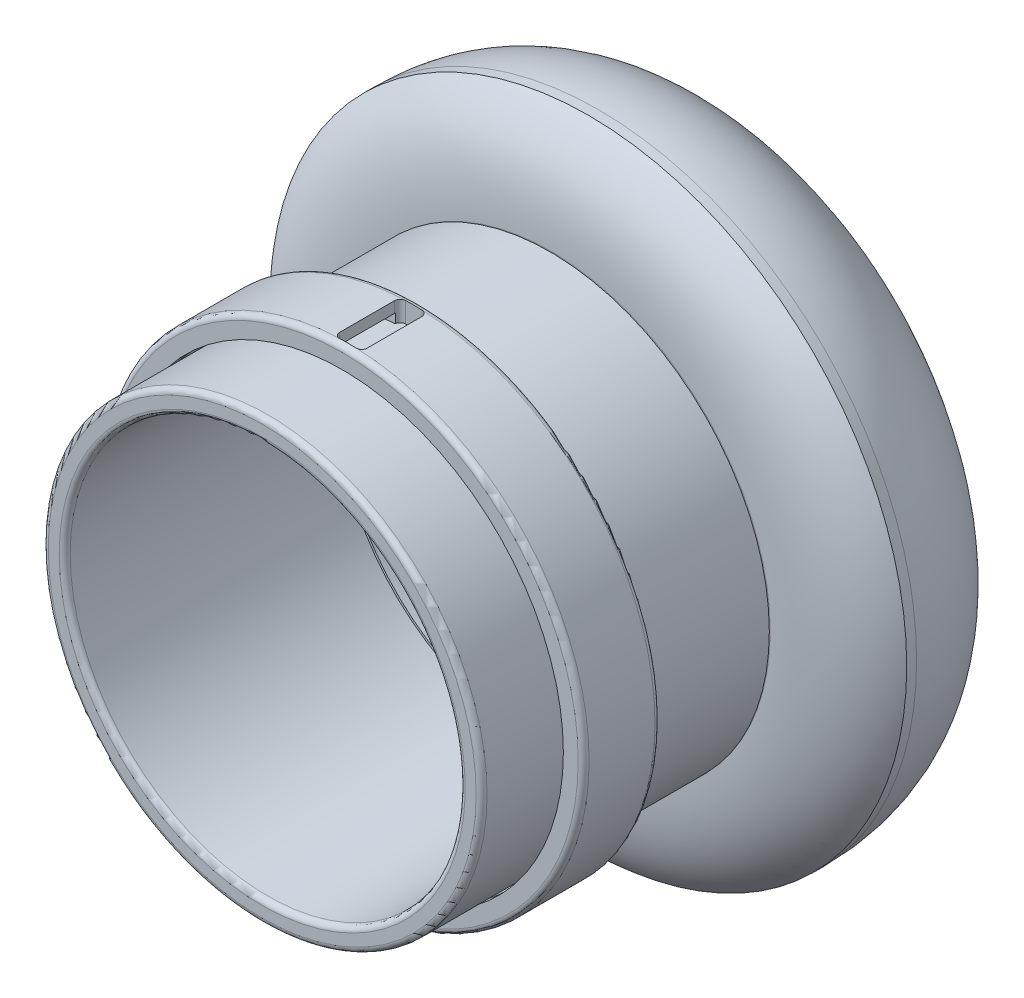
ISO-10303-21;
HEADER;
FILE_DESCRIPTION(('STEP AP214'),'2;1');
FILE_NAME('part.step','',(''),(''),'','','');
FILE_SCHEMA(('AUTOMOTIVE_DESIGN { 1 0 10303 214 1 1 1 1 }'));
ENDSEC;
DATA;
#1=APPLICATION_CONTEXT('core data for automotive mechanical design processes');
#2=APPLICATION_PROTOCOL_DEFINITION('international standard','automotive_design',2000,#1);
#3=PRODUCT_CONTEXT('',#1,'mechanical');
#4=PRODUCT('Part','Part','',(#3));
#5=PRODUCT_RELATED_PRODUCT_CATEGORY('part','',(#4));
#6=PRODUCT_DEFINITION_FORMATION('','',#4);
#7=PRODUCT_DEFINITION_CONTEXT('part definition',#1,'design');
#8=PRODUCT_DEFINITION('design','',#6,#7);
#9=PRODUCT_DEFINITION_SHAPE('','',#8);
#10=(LENGTH_UNIT() NAMED_UNIT(*) SI_UNIT(.MILLI.,.METRE.));
#11=(NAMED_UNIT(*) PLANE_ANGLE_UNIT() SI_UNIT($,.RADIAN.));
#12=(NAMED_UNIT(*) SI_UNIT($,.STERADIAN.) SOLID_ANGLE_UNIT());
#13=UNCERTAINTY_MEASURE_WITH_UNIT(LENGTH_MEASURE(1.E-05),#10,'distance_accuracy_value','');
#14=(GEOMETRIC_REPRESENTATION_CONTEXT(3) GLOBAL_UNCERTAINTY_ASSIGNED_CONTEXT((#13)) GLOBAL_UNIT_ASSIGNED_CONTEXT((#10,
#11,#12)) REPRESENTATION_CONTEXT('',''));
#15=CARTESIAN_POINT('',(0.,0.,0.));
#16=DIRECTION('',(0.,0.,1.));
#17=DIRECTION('',(1.,0.,0.));
#18=AXIS2_PLACEMENT_3D('',#15,#16,#17);
#19=CARTESIAN_POINT('',(0.,0.,73.3963484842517));
#20=DIRECTION('',(0.,0.,-1.));
#21=DIRECTION('',(-1.,0.,0.));
#22=AXIS2_PLACEMENT_3D('',#19,#20,#21);
#23=CYLINDRICAL_SURFACE('',#22,40.3);
#24=CARTESIAN_POINT('',(0.,0.,59.3963484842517));
#25=DIRECTION('',(0.,0.,1.));
#26=DIRECTION('',(1.,0.,0.));
#27=AXIS2_PLACEMENT_3D('',#24,#25,#26);
#28=CIRCLE('',#27,40.3);
#29=CARTESIAN_POINT('',(40.3,0.,59.3963484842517));
#30=VERTEX_POINT('',#29);
#31=EDGE_CURVE('E147',#30,#30,#28,.T.);
#32=ORIENTED_EDGE('',*,*,#31,.F.);
#33=EDGE_LOOP('',(#32));
#34=FACE_BOUND('',#33,.T.);
#35=CARTESIAN_POINT('',(0.,0.,61.2463484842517));
#36=DIRECTION('',(0.,0.,1.));
#37=DIRECTION('',(1.,0.,0.));
#38=AXIS2_PLACEMENT_3D('',#35,#36,#37);
#39=CIRCLE('',#38,40.3);
#40=CARTESIAN_POINT('',(-2.48868599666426,40.2230834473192,61.2463484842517));
#41=VERTEX_POINT('',#40);
#42=CARTESIAN_POINT('',(2.48868599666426,40.2230834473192,61.2463484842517));
#43=VERTEX_POINT('',#42);
#44=EDGE_CURVE('E138',#41,#43,#39,.T.);
#45=ORIENTED_EDGE('',*,*,#44,.T.);
#46=CARTESIAN_POINT('',(2.48868599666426,40.2230834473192,61.2463484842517));
#47=CARTESIAN_POINT('',(2.48446861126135,40.2233442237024,61.2185517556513));
#48=CARTESIAN_POINT('',(2.47908068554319,40.2236770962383,61.1909469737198));
#49=CARTESIAN_POINT('',(2.46600256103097,40.2244810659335,61.1362919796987));
#50=CARTESIAN_POINT('',(2.45831249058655,40.2249521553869,61.1092417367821));
#51=CARTESIAN_POINT('',(2.43187509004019,40.2265621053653,61.0292610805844));
#52=CARTESIAN_POINT('',(2.40974657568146,40.227898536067,60.9774091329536));
#53=CARTESIAN_POINT('',(2.3571149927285,40.2310166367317,60.8781644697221));
#54=CARTESIAN_POINT('',(2.32660811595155,40.2327985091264,60.8307737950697));
#55=CARTESIAN_POINT('',(2.25809424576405,40.2367019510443,60.741792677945));
#56=CARTESIAN_POINT('',(2.22008925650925,40.2388234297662,60.7002006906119));
#57=CARTESIAN_POINT('',(2.13761023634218,40.2432892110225,60.6239418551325));
#58=CARTESIAN_POINT('',(2.09312938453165,40.2456337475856,60.5892824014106));
#59=CARTESIAN_POINT('',(1.99895767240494,40.25042096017,60.5279009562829));
#60=CARTESIAN_POINT('',(1.94926378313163,40.2528636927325,60.5011836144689));
#61=CARTESIAN_POINT('',(1.84600400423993,40.2577315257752,60.4564250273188));
#62=CARTESIAN_POINT('',(1.79243091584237,40.2601565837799,60.4384004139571));
#63=CARTESIAN_POINT('',(1.68309237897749,40.2648751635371,60.4116494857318));
#64=CARTESIAN_POINT('',(1.62733147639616,40.2671689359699,60.4029048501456));
#65=CARTESIAN_POINT('',(1.54754994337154,40.2702827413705,60.3971933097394));
#66=CARTESIAN_POINT('',(1.52376870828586,40.271189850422,60.3963425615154));
#67=CARTESIAN_POINT('',(1.5,40.2720746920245,60.3963484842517));
#68=B_SPLINE_CURVE_WITH_KNOTS('',3,(#46,#47,#48,#49,#50,#51,#52,#53,#54,#55,#56,#57,#58,#59,#60,
#61,#62,#63,#64,#65,#66,#67),.UNSPECIFIED.,.F.,.F.,(4,2,2,2,2,2,2,2,2,2,4),(0.,
0.084296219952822,0.168587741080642,0.336896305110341,0.505281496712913,0.673621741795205,
0.842140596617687,1.0107579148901,1.17969658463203,1.34830110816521,1.41967715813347),.UNSPECIFIED.);
#69=CARTESIAN_POINT('',(1.5,40.2720746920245,60.3963484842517));
#70=VERTEX_POINT('',#69);
#71=EDGE_CURVE('E142',#43,#70,#68,.T.);
#72=ORIENTED_EDGE('',*,*,#71,.T.);
#73=CARTESIAN_POINT('',(0.,0.,60.3963484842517));
#74=DIRECTION('',(0.,0.,1.));
#75=DIRECTION('',(1.,0.,0.));
#76=AXIS2_PLACEMENT_3D('',#73,#74,#75);
#77=CIRCLE('',#76,40.3);
#78=CARTESIAN_POINT('',(-1.5,40.2720746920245,60.3963484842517));
#79=VERTEX_POINT('',#78);
#80=EDGE_CURVE('E336',#70,#79,#77,.T.);
#81=ORIENTED_EDGE('',*,*,#80,.T.);
#82=CARTESIAN_POINT('',(-1.5,40.2720746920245,60.3963484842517));
#83=CARTESIAN_POINT('',(-1.52815985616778,40.2710259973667,60.3963486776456));
#84=CARTESIAN_POINT('',(-1.55630506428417,40.2699479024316,60.3975386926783));
#85=CARTESIAN_POINT('',(-1.6123916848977,40.2677411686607,60.4022856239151));
#86=CARTESIAN_POINT('',(-1.64033310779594,40.2666125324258,60.405842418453));
#87=CARTESIAN_POINT('',(-1.7235076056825,40.2631666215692,60.4200292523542));
#88=CARTESIAN_POINT('',(-1.77817997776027,40.2607860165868,60.4341758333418));
#89=CARTESIAN_POINT('',(-1.88436633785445,40.2559560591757,60.4714513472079));
#90=CARTESIAN_POINT('',(-1.93587880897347,40.2535066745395,60.4945845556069));
#91=CARTESIAN_POINT('',(-2.03427988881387,40.2486537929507,60.5491721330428));
#92=CARTESIAN_POINT('',(-2.08116981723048,40.2462502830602,60.5806241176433));
#93=CARTESIAN_POINT('',(-2.16900601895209,40.2416121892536,60.6509641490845));
#94=CARTESIAN_POINT('',(-2.20995190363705,40.2393776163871,60.68985268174));
#95=CARTESIAN_POINT('',(-2.28475633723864,40.2351997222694,60.7739924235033));
#96=CARTESIAN_POINT('',(-2.31861075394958,40.2332565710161,60.8192473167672));
#97=CARTESIAN_POINT('',(-2.37822856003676,40.2297765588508,60.9148012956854));
#98=CARTESIAN_POINT('',(-2.40399333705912,40.2282396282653,60.9650995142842));
#99=CARTESIAN_POINT('',(-2.44665650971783,40.2256676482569,61.0692471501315));
#100=CARTESIAN_POINT('',(-2.46357262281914,40.2246315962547,61.1230892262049));
#101=CARTESIAN_POINT('',(-2.4809280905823,40.2235628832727,61.2005800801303));
#102=CARTESIAN_POINT('',(-2.48521147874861,40.223298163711,61.223409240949));
#103=CARTESIAN_POINT('',(-2.48868599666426,40.2230834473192,61.2463484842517));
#104=B_SPLINE_CURVE_WITH_KNOTS('',3,(#82,#83,#84,#85,#86,#87,#88,#89,#90,#91,#92,#93,#94,#95,
#96,#97,#98,#99,#100,#101,#102,#103),.UNSPECIFIED.,.F.,.F.,(4,2,2,2,2,2,2,2,2,2,4),(0.,
0.0844861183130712,0.16896789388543,0.337667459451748,0.506447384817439,0.675178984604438,
0.84392161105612,1.01276229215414,1.18157399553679,1.35004638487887,1.4196725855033),.UNSPECIFIED.);
#105=EDGE_CURVE('E144',#79,#41,#104,.T.);
#106=ORIENTED_EDGE('',*,*,#105,.T.);
#107=EDGE_LOOP('',(#45,#72,#81,#106));
#108=FACE_BOUND('',#107,.T.);
#109=ADVANCED_FACE('F59',(#34,#108),#23,.F.);
#110=CARTESIAN_POINT('',(0.,0.,73.3963484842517));
#111=DIRECTION('',(0.,0.,-1.));
#112=DIRECTION('',(-1.,0.,0.));
#113=AXIS2_PLACEMENT_3D('',#110,#111,#112);
#114=CYLINDRICAL_SURFACE('',#113,44.);
#115=DIRECTION('',(0.,0.,-1.));
#116=VECTOR('',#115,1.);
#117=CARTESIAN_POINT('',(2.5,43.9289198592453,73.3963484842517));
#118=LINE('',#117,#116);
#119=CARTESIAN_POINT('',(2.5,43.9289198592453,71.3963484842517));
#120=VERTEX_POINT('',#119);
#121=CARTESIAN_POINT('',(2.5,43.9289198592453,61.3963484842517));
#122=VERTEX_POINT('',#121);
#123=EDGE_CURVE('E326',#120,#122,#118,.T.);
#124=ORIENTED_EDGE('',*,*,#123,.F.);
#125=CARTESIAN_POINT('',(2.5,43.9289198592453,71.3963484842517));
#126=CARTESIAN_POINT('',(2.49999983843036,43.9289197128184,71.4244539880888));
#127=CARTESIAN_POINT('',(2.49881437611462,43.9289873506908,71.4525460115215));
#128=CARTESIAN_POINT('',(2.49408525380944,43.9292561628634,71.5085287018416));
#129=CARTESIAN_POINT('',(2.49054171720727,43.9294573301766,71.5364193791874));
#130=CARTESIAN_POINT('',(2.47640848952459,43.9302571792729,71.6194378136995));
#131=CARTESIAN_POINT('',(2.46231608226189,43.9310522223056,71.6740089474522));
#132=CARTESIAN_POINT('',(2.42518500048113,43.9331175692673,71.7800046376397));
#133=CARTESIAN_POINT('',(2.40214222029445,43.9343880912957,71.831427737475));
#134=CARTESIAN_POINT('',(2.34777004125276,43.9373271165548,71.9296736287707));
#135=CARTESIAN_POINT('',(2.31644195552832,43.9389955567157,71.9764971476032));
#136=CARTESIAN_POINT('',(2.24635901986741,43.9426341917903,72.0642595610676));
#137=CARTESIAN_POINT('',(2.20759784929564,43.9446046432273,72.1051933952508));
#138=CARTESIAN_POINT('',(2.12375533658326,43.9487362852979,72.1799842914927));
#139=CARTESIAN_POINT('',(2.07867273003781,43.9508975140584,72.2138399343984));
#140=CARTESIAN_POINT('',(1.98340294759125,43.9552998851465,72.2735532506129));
#141=CARTESIAN_POINT('',(1.93320811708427,43.9575411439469,72.2993986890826));
#142=CARTESIAN_POINT('',(1.82919962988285,43.9619918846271,72.3422802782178));
#143=CARTESIAN_POINT('',(1.77538809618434,43.9642013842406,72.3593215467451));
#144=CARTESIAN_POINT('',(1.68437705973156,43.967763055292,72.3799053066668));
#145=CARTESIAN_POINT('',(1.64774995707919,43.9691513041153,72.3860673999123));
#146=CARTESIAN_POINT('',(1.57408758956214,43.9718502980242,72.3942885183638));
#147=CARTESIAN_POINT('',(1.53705296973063,43.9731611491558,72.3963532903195));
#148=CARTESIAN_POINT('',(1.5,43.97442438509,72.3963484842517));
#149=B_SPLINE_CURVE_WITH_KNOTS('',3,(#125,#126,#127,#128,#129,#130,#131,#132,#133,#134,#135,
#136,#137,#138,#139,#140,#141,#142,#143,#144,#145,#146,#147,#148),.UNSPECIFIED.,.F.,.F.,(4,2,2,
2,2,2,2,2,2,2,2,4),(0.,0.0842646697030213,0.1685249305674,0.336758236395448,0.505068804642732,
0.673352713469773,0.841780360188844,1.01024174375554,1.17895918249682,1.34757843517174,
1.45886817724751,1.57000171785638),.UNSPECIFIED.);
#150=CARTESIAN_POINT('',(1.5,43.97442438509,72.3963484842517));
#151=VERTEX_POINT('',#150);
#152=EDGE_CURVE('E233',#120,#151,#149,.T.);
#153=ORIENTED_EDGE('',*,*,#152,.T.);
#154=CARTESIAN_POINT('',(0.,0.,72.3963484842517));
#155=DIRECTION('',(0.,0.,1.));
#156=DIRECTION('',(1.,0.,0.));
#157=AXIS2_PLACEMENT_3D('',#154,#155,#156);
#158=CIRCLE('',#157,44.);
#159=CARTESIAN_POINT('',(-1.5,43.97442438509,72.3963484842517));
#160=VERTEX_POINT('',#159);
#161=EDGE_CURVE('E335',#151,#160,#158,.F.);
#162=ORIENTED_EDGE('',*,*,#161,.T.);
#163=CARTESIAN_POINT('',(-1.5,43.97442438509,72.3963484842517));
#164=CARTESIAN_POINT('',(-1.52815689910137,43.9734640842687,72.3963482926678));
#165=CARTESIAN_POINT('',(-1.55629933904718,43.9724768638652,72.3951585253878));
#166=CARTESIAN_POINT('',(-1.61238081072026,43.9704561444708,72.3904125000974));
#167=CARTESIAN_POINT('',(-1.64031985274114,43.9694226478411,72.3868563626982));
#168=CARTESIAN_POINT('',(-1.72348271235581,43.9662674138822,72.3726728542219));
#169=CARTESIAN_POINT('',(-1.77814651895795,43.9640877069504,72.3585302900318));
#170=CARTESIAN_POINT('',(-1.88431706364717,43.9596654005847,72.3212655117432));
#171=CARTESIAN_POINT('',(-1.93582231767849,43.9574227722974,72.2981391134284));
#172=CARTESIAN_POINT('',(-2.03421656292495,43.9529792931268,72.2435645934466));
#173=CARTESIAN_POINT('',(-2.08110633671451,43.9507784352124,72.2121178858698));
#174=CARTESIAN_POINT('',(-2.16894709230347,43.9465312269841,72.1417858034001));
#175=CARTESIAN_POINT('',(-2.20989707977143,43.9444849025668,72.1028991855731));
#176=CARTESIAN_POINT('',(-2.2846944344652,43.9406597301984,72.0187809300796));
#177=CARTESIAN_POINT('',(-2.31854043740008,43.9388809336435,71.9735480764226));
#178=CARTESIAN_POINT('',(-2.37813599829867,43.9356957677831,71.8780582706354));
#179=CARTESIAN_POINT('',(-2.40388988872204,43.9342891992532,71.8278040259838));
#180=CARTESIAN_POINT('',(-2.44657906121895,43.9319327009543,71.7236845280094));
#181=CARTESIAN_POINT('',(-2.46351967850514,43.930982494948,71.6698214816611));
#182=CARTESIAN_POINT('',(-2.48385193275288,43.9298366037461,71.5790770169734));
#183=CARTESIAN_POINT('',(-2.48990372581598,43.9294935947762,71.542771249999));
#184=CARTESIAN_POINT('',(-2.4979772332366,43.9290349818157,71.4697649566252));
#185=CARTESIAN_POINT('',(-2.5000046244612,43.9289190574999,71.4330650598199));
#186=CARTESIAN_POINT('',(-2.5,43.9289198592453,71.3963484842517));
#187=B_SPLINE_CURVE_WITH_KNOTS('',3,(#163,#164,#165,#166,#167,#168,#169,#170,#171,#172,#173,
#174,#175,#176,#177,#178,#179,#180,#181,#182,#183,#184,#185,#186),.UNSPECIFIED.,.F.,.F.,(4,2,2,
2,2,2,2,2,2,2,2,4),(0.,0.0844678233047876,0.168931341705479,0.337579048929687,0.506305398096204,
0.675003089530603,0.843728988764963,1.01248726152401,1.18115502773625,1.34972056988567,
1.45993730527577,1.56999845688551),.UNSPECIFIED.);
#188=CARTESIAN_POINT('',(-2.5,43.9289198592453,71.3963484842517));
#189=VERTEX_POINT('',#188);
#190=EDGE_CURVE('E210',#160,#189,#187,.T.);
#191=ORIENTED_EDGE('',*,*,#190,.T.);
#192=DIRECTION('',(0.,0.,-1.));
#193=VECTOR('',#192,1.);
#194=CARTESIAN_POINT('',(-2.5,43.9289198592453,73.3963484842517));
#195=LINE('',#194,#193);
#196=CARTESIAN_POINT('',(-2.5,43.9289198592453,61.3963484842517));
#197=VERTEX_POINT('',#196);
#198=EDGE_CURVE('E327',#197,#189,#195,.F.);
#199=ORIENTED_EDGE('',*,*,#198,.F.);
#200=CARTESIAN_POINT('',(-2.5,43.9289198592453,61.3963484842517));
#201=CARTESIAN_POINT('',(-2.49999983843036,43.9289197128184,61.3682429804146));
#202=CARTESIAN_POINT('',(-2.49881437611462,43.9289873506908,61.3401509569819));
#203=CARTESIAN_POINT('',(-2.49408525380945,43.9292561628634,61.2841682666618));
#204=CARTESIAN_POINT('',(-2.49054171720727,43.9294573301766,61.2562775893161));
#205=CARTESIAN_POINT('',(-2.47640848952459,43.9302571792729,61.1732591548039));
#206=CARTESIAN_POINT('',(-2.46231608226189,43.9310522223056,61.1186880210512));
#207=CARTESIAN_POINT('',(-2.42518500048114,43.9331175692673,61.0126923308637));
#208=CARTESIAN_POINT('',(-2.40214222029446,43.9343880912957,60.9612692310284));
#209=CARTESIAN_POINT('',(-2.34777004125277,43.9373271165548,60.8630233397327));
#210=CARTESIAN_POINT('',(-2.31644195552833,43.9389955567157,60.8161998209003));
#211=CARTESIAN_POINT('',(-2.24635901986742,43.9426341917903,60.7284374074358));
#212=CARTESIAN_POINT('',(-2.20759784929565,43.9446046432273,60.6875035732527));
#213=CARTESIAN_POINT('',(-2.12375533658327,43.9487362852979,60.6127126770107));
#214=CARTESIAN_POINT('',(-2.07867273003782,43.9508975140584,60.578857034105));
#215=CARTESIAN_POINT('',(-1.98340294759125,43.9552998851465,60.5191437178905));
#216=CARTESIAN_POINT('',(-1.93320811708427,43.9575411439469,60.4932982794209));
#217=CARTESIAN_POINT('',(-1.82919962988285,43.9619918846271,60.4504166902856));
#218=CARTESIAN_POINT('',(-1.77538809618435,43.9642013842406,60.4333754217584));
#219=CARTESIAN_POINT('',(-1.68437705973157,43.967763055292,60.4127916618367));
#220=CARTESIAN_POINT('',(-1.6477499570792,43.9691513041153,60.4066295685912));
#221=CARTESIAN_POINT('',(-1.57408758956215,43.9718502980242,60.3984084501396));
#222=CARTESIAN_POINT('',(-1.53705296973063,43.9731611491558,60.3963436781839));
#223=CARTESIAN_POINT('',(-1.5,43.97442438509,60.3963484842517));
#224=B_SPLINE_CURVE_WITH_KNOTS('',3,(#200,#201,#202,#203,#204,#205,#206,#207,#208,#209,#210,
#211,#212,#213,#214,#215,#216,#217,#218,#219,#220,#221,#222,#223),.UNSPECIFIED.,.F.,.F.,(4,2,2,
2,2,2,2,2,2,2,2,4),(0.,0.0842646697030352,0.168524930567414,0.336758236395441,0.505068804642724,
0.67335271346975,0.841780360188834,1.01024174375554,1.17895918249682,1.34757843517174,
1.45886817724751,1.57000171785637),.UNSPECIFIED.);
#225=CARTESIAN_POINT('',(-1.5,43.97442438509,60.3963484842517));
#226=VERTEX_POINT('',#225);
#227=EDGE_CURVE('E13',#197,#226,#224,.T.);
#228=ORIENTED_EDGE('',*,*,#227,.T.);
#229=CARTESIAN_POINT('',(0.,0.,60.3963484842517));
#230=DIRECTION('',(0.,0.,1.));
#231=DIRECTION('',(1.,0.,0.));
#232=AXIS2_PLACEMENT_3D('',#229,#230,#231);
#233=CIRCLE('',#232,44.);
#234=CARTESIAN_POINT('',(1.5,43.97442438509,60.3963484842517));
#235=VERTEX_POINT('',#234);
#236=EDGE_CURVE('E79',#226,#235,#233,.T.);
#237=ORIENTED_EDGE('',*,*,#236,.T.);
#238=CARTESIAN_POINT('',(1.5,43.97442438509,60.3963484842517));
#239=CARTESIAN_POINT('',(1.52815689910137,43.9734640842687,60.3963486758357));
#240=CARTESIAN_POINT('',(1.55629933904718,43.9724768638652,60.3975384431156));
#241=CARTESIAN_POINT('',(1.61238081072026,43.9704561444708,60.4022844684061));
#242=CARTESIAN_POINT('',(1.64031985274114,43.9694226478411,60.4058406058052));
#243=CARTESIAN_POINT('',(1.72348271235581,43.9662674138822,60.4200241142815));
#244=CARTESIAN_POINT('',(1.77814651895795,43.9640877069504,60.4341666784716));
#245=CARTESIAN_POINT('',(1.88431706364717,43.9596654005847,60.4714314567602));
#246=CARTESIAN_POINT('',(1.93582231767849,43.9574227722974,60.494557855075));
#247=CARTESIAN_POINT('',(2.03421656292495,43.9529792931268,60.5491323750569));
#248=CARTESIAN_POINT('',(2.08110633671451,43.9507784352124,60.5805790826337));
#249=CARTESIAN_POINT('',(2.16894709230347,43.9465312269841,60.6509111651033));
#250=CARTESIAN_POINT('',(2.20989707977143,43.9444849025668,60.6897977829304));
#251=CARTESIAN_POINT('',(2.2846944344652,43.9406597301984,60.7739160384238));
#252=CARTESIAN_POINT('',(2.31854043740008,43.9388809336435,60.8191488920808));
#253=CARTESIAN_POINT('',(2.37813599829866,43.9356957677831,60.914638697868));
#254=CARTESIAN_POINT('',(2.40388988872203,43.9342891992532,60.9648929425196));
#255=CARTESIAN_POINT('',(2.44657906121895,43.9319327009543,61.0690124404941));
#256=CARTESIAN_POINT('',(2.46351967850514,43.930982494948,61.1228754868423));
#257=CARTESIAN_POINT('',(2.48385193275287,43.9298366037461,61.2136199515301));
#258=CARTESIAN_POINT('',(2.48990372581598,43.9294935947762,61.2499257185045));
#259=CARTESIAN_POINT('',(2.4979772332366,43.9290349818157,61.3229320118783));
#260=CARTESIAN_POINT('',(2.5000046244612,43.9289190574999,61.3596319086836));
#261=CARTESIAN_POINT('',(2.5,43.9289198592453,61.3963484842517));
#262=B_SPLINE_CURVE_WITH_KNOTS('',3,(#238,#239,#240,#241,#242,#243,#244,#245,#246,#247,#248,
#249,#250,#251,#252,#253,#254,#255,#256,#257,#258,#259,#260,#261),.UNSPECIFIED.,.F.,.F.,(4,2,2,
2,2,2,2,2,2,2,2,4),(0.,0.0844678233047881,0.16893134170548,0.337579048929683,0.506305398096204,
0.675003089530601,0.843728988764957,1.012487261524,1.18115502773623,1.34972056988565,
1.45993730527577,1.56999845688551),.UNSPECIFIED.);
#263=EDGE_CURVE('E161',#235,#122,#262,.T.);
#264=ORIENTED_EDGE('',*,*,#263,.T.);
#265=EDGE_LOOP('',(#124,#153,#162,#191,#199,#228,#237,#264));
#266=FACE_BOUND('',#265,.T.);
#267=ADVANCED_FACE('F181',(#266),#114,.T.);
#268=CARTESIAN_POINT('',(0.,0.,73.3963484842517));
#269=DIRECTION('',(0.,0.,1.));
#270=DIRECTION('',(1.,0.,0.));
#271=AXIS2_PLACEMENT_3D('',#268,#269,#270);
#272=CIRCLE('',#271,40.3);
#273=CARTESIAN_POINT('',(40.3,0.,73.3963484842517));
#274=VERTEX_POINT('',#273);
#275=EDGE_CURVE('E343',#274,#274,#272,.T.);
#276=ORIENTED_EDGE('',*,*,#275,.T.);
#277=EDGE_LOOP('',(#276));
#278=FACE_BOUND('',#277,.T.);
#279=CARTESIAN_POINT('',(0.,0.,71.5463484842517));
#280=DIRECTION('',(0.,0.,1.));
#281=DIRECTION('',(1.,0.,0.));
#282=AXIS2_PLACEMENT_3D('',#279,#280,#281);
#283=CIRCLE('',#282,40.3);
#284=CARTESIAN_POINT('',(-2.48868599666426,40.2230834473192,71.5463484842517));
#285=VERTEX_POINT('',#284);
#286=CARTESIAN_POINT('',(2.48868599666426,40.2230834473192,71.5463484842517));
#287=VERTEX_POINT('',#286);
#288=EDGE_CURVE('E148',#285,#287,#283,.T.);
#289=ORIENTED_EDGE('',*,*,#288,.F.);
#290=CARTESIAN_POINT('',(-2.48868599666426,40.2230834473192,71.5463484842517));
#291=CARTESIAN_POINT('',(-2.48446861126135,40.2233442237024,71.5741452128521));
#292=CARTESIAN_POINT('',(-2.47908068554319,40.2236770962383,71.6017499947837));
#293=CARTESIAN_POINT('',(-2.46600256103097,40.2244810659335,71.6564049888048));
#294=CARTESIAN_POINT('',(-2.45831249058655,40.2249521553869,71.6834552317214));
#295=CARTESIAN_POINT('',(-2.43187509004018,40.2265621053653,71.7634358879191));
#296=CARTESIAN_POINT('',(-2.40974657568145,40.227898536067,71.8152878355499));
#297=CARTESIAN_POINT('',(-2.3571149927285,40.2310166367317,71.9145324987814));
#298=CARTESIAN_POINT('',(-2.32660811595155,40.2327985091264,71.9619231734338));
#299=CARTESIAN_POINT('',(-2.25809424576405,40.2367019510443,72.0509042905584));
#300=CARTESIAN_POINT('',(-2.22008925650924,40.2388234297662,72.0924962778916));
#301=CARTESIAN_POINT('',(-2.13761023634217,40.2432892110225,72.168755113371));
#302=CARTESIAN_POINT('',(-2.09312938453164,40.2456337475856,72.2034145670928));
#303=CARTESIAN_POINT('',(-1.99895767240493,40.25042096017,72.2647960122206));
#304=CARTESIAN_POINT('',(-1.94926378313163,40.2528636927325,72.2915133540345));
#305=CARTESIAN_POINT('',(-1.84600400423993,40.2577315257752,72.3362719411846));
#306=CARTESIAN_POINT('',(-1.79243091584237,40.2601565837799,72.3542965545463));
#307=CARTESIAN_POINT('',(-1.68309237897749,40.2648751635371,72.3810474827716));
#308=CARTESIAN_POINT('',(-1.62733147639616,40.2671689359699,72.3897921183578));
#309=CARTESIAN_POINT('',(-1.54754994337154,40.2702827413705,72.3955036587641));
#310=CARTESIAN_POINT('',(-1.52376870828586,40.271189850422,72.396354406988));
#311=CARTESIAN_POINT('',(-1.5,40.2720746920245,72.3963484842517));
#312=B_SPLINE_CURVE_WITH_KNOTS('',3,(#290,#291,#292,#293,#294,#295,#296,#297,#298,#299,#300,
#301,#302,#303,#304,#305,#306,#307,#308,#309,#310,#311),.UNSPECIFIED.,.F.,.F.,(4,2,2,2,2,2,2,2,
2,2,4),(0.,0.0842962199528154,0.168587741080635,0.336896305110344,0.505281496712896,
0.6736217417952,0.842140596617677,1.01075791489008,1.17969658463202,1.3483011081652,
1.41967715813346),.UNSPECIFIED.);
#313=CARTESIAN_POINT('',(-1.5,40.2720746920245,72.3963484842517));
#314=VERTEX_POINT('',#313);
#315=EDGE_CURVE('E202',#285,#314,#312,.T.);
#316=ORIENTED_EDGE('',*,*,#315,.T.);
#317=CARTESIAN_POINT('',(0.,0.,72.3963484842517));
#318=DIRECTION('',(0.,0.,-1.));
#319=DIRECTION('',(-1.,0.,0.));
#320=AXIS2_PLACEMENT_3D('',#317,#318,#319);
#321=CIRCLE('',#320,40.3);
#322=CARTESIAN_POINT('',(1.5,40.2720746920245,72.3963484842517));
#323=VERTEX_POINT('',#322);
#324=EDGE_CURVE('E376',#314,#323,#321,.T.);
#325=ORIENTED_EDGE('',*,*,#324,.T.);
#326=CARTESIAN_POINT('',(1.5,40.2720746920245,72.3963484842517));
#327=CARTESIAN_POINT('',(1.52815985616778,40.2710259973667,72.3963482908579));
#328=CARTESIAN_POINT('',(1.55630506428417,40.2699479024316,72.3951582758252));
#329=CARTESIAN_POINT('',(1.61239168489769,40.2677411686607,72.3904113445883));
#330=CARTESIAN_POINT('',(1.64033310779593,40.2666125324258,72.3868545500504));
#331=CARTESIAN_POINT('',(1.72350760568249,40.2631666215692,72.3726677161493));
#332=CARTESIAN_POINT('',(1.77817997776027,40.2607860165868,72.3585211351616));
#333=CARTESIAN_POINT('',(1.88436633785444,40.2559560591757,72.3212456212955));
#334=CARTESIAN_POINT('',(1.93587880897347,40.2535066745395,72.2981124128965));
#335=CARTESIAN_POINT('',(2.03427988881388,40.2486537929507,72.2435248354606));
#336=CARTESIAN_POINT('',(2.08116981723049,40.2462502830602,72.2120728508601));
#337=CARTESIAN_POINT('',(2.16900601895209,40.2416121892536,72.1417328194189));
#338=CARTESIAN_POINT('',(2.20995190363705,40.2393776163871,72.1028442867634));
#339=CARTESIAN_POINT('',(2.28475633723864,40.2351997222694,72.0187045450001));
#340=CARTESIAN_POINT('',(2.31861075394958,40.2332565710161,71.9734496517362));
#341=CARTESIAN_POINT('',(2.37822856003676,40.2297765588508,71.877895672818));
#342=CARTESIAN_POINT('',(2.40399333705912,40.2282396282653,71.8275974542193));
#343=CARTESIAN_POINT('',(2.44665650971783,40.2256676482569,71.723449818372));
#344=CARTESIAN_POINT('',(2.46357262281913,40.2246315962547,71.6696077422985));
#345=CARTESIAN_POINT('',(2.4809280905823,40.2235628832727,71.5921168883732));
#346=CARTESIAN_POINT('',(2.48521147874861,40.223298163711,71.5692877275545));
#347=CARTESIAN_POINT('',(2.48868599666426,40.2230834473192,71.5463484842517));
#348=B_SPLINE_CURVE_WITH_KNOTS('',3,(#326,#327,#328,#329,#330,#331,#332,#333,#334,#335,#336,
#337,#338,#339,#340,#341,#342,#343,#344,#345,#346,#347),.UNSPECIFIED.,.F.,.F.,(4,2,2,2,2,2,2,2,
2,2,4),(0.,0.0844861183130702,0.168967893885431,0.337667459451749,0.506447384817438,
0.67517898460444,0.843921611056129,1.01276229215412,1.1815739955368,1.35004638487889,
1.41967258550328),.UNSPECIFIED.);
#349=EDGE_CURVE('E192',#323,#287,#348,.T.);
#350=ORIENTED_EDGE('',*,*,#349,.T.);
#351=EDGE_LOOP('',(#289,#316,#325,#350));
#352=FACE_BOUND('',#351,.T.);
#353=ADVANCED_FACE('F183',(#278,#352),#23,.F.);
#354=CARTESIAN_POINT('',(0.,0.,61.2463484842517));
#355=DIRECTION('',(0.,0.,1.));
#356=DIRECTION('',(1.,0.,0.));
#357=AXIS2_PLACEMENT_3D('',#354,#355,#356);
#358=CYLINDRICAL_SURFACE('',#357,42.);
#359=DIRECTION('',(0.,0.,1.));
#360=VECTOR('',#359,1.);
#361=CARTESIAN_POINT('',(2.5,41.925529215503,61.2463484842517));
#362=LINE('',#361,#360);
#363=CARTESIAN_POINT('',(2.5,41.925529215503,61.3963484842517));
#364=VERTEX_POINT('',#363);
#365=CARTESIAN_POINT('',(2.5,41.925529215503,71.3963484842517));
#366=VERTEX_POINT('',#365);
#367=EDGE_CURVE('E316',#364,#366,#362,.T.);
#368=ORIENTED_EDGE('',*,*,#367,.F.);
#369=CARTESIAN_POINT('',(2.5,41.925529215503,61.3963484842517));
#370=CARTESIAN_POINT('',(2.49999728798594,41.9255295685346,61.3712059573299));
#371=CARTESIAN_POINT('',(2.49905309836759,41.9255858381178,61.3461346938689));
#372=CARTESIAN_POINT('',(2.49528176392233,41.9258102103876,61.2961346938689));
#373=CARTESIAN_POINT('',(2.49245461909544,41.9259783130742,61.2712059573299));
#374=CARTESIAN_POINT('',(2.48868599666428,41.9262023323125,61.2463484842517));
#375=B_SPLINE_CURVE_WITH_KNOTS('',3,(#369,#370,#371,#372,#373,#374),.UNSPECIFIED.,.F.,.F.,(4,2,
4),(0.,0.0752672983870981,0.150534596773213),.UNSPECIFIED.);
#376=CARTESIAN_POINT('',(2.48868599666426,41.9262023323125,61.2463484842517));
#377=VERTEX_POINT('',#376);
#378=EDGE_CURVE('E155',#364,#377,#375,.T.);
#379=ORIENTED_EDGE('',*,*,#378,.T.);
#380=CARTESIAN_POINT('',(0.,0.,61.2463484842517));
#381=DIRECTION('',(0.,0.,1.));
#382=DIRECTION('',(1.,0.,0.));
#383=AXIS2_PLACEMENT_3D('',#380,#381,#382);
#384=CIRCLE('',#383,42.);
#385=CARTESIAN_POINT('',(-2.48868599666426,41.9262023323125,61.2463484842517));
#386=VERTEX_POINT('',#385);
#387=EDGE_CURVE('E88',#386,#377,#384,.T.);
#388=ORIENTED_EDGE('',*,*,#387,.F.);
#389=CARTESIAN_POINT('',(-2.48868599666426,41.9262023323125,61.2463484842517));
#390=CARTESIAN_POINT('',(-2.49245461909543,41.9259783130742,61.2712059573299));
#391=CARTESIAN_POINT('',(-2.49528176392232,41.9258102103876,61.2961346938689));
#392=CARTESIAN_POINT('',(-2.4990530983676,41.9255858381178,61.3461346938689));
#393=CARTESIAN_POINT('',(-2.49999728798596,41.9255295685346,61.3712059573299));
#394=CARTESIAN_POINT('',(-2.50000000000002,41.9255292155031,61.3963484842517));
#395=B_SPLINE_CURVE_WITH_KNOTS('',3,(#389,#390,#391,#392,#393,#394),.UNSPECIFIED.,.F.,.F.,(4,2,
4),(0.,0.0752672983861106,0.150534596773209),.UNSPECIFIED.);
#396=CARTESIAN_POINT('',(-2.5,41.925529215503,61.3963484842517));
#397=VERTEX_POINT('',#396);
#398=EDGE_CURVE('E73',#386,#397,#395,.T.);
#399=ORIENTED_EDGE('',*,*,#398,.T.);
#400=DIRECTION('',(0.,0.,1.));
#401=VECTOR('',#400,1.);
#402=CARTESIAN_POINT('',(-2.5,41.925529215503,61.2463484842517));
#403=LINE('',#402,#401);
#404=CARTESIAN_POINT('',(-2.5,41.925529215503,71.3963484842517));
#405=VERTEX_POINT('',#404);
#406=EDGE_CURVE('E368',#405,#397,#403,.F.);
#407=ORIENTED_EDGE('',*,*,#406,.F.);
#408=CARTESIAN_POINT('',(-2.5,41.925529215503,71.3963484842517));
#409=CARTESIAN_POINT('',(-2.49999728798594,41.9255295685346,71.4214910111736));
#410=CARTESIAN_POINT('',(-2.49905309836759,41.9255858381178,71.4465622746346));
#411=CARTESIAN_POINT('',(-2.49528176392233,41.9258102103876,71.4965622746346));
#412=CARTESIAN_POINT('',(-2.49245461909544,41.9259783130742,71.5214910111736));
#413=CARTESIAN_POINT('',(-2.48868599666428,41.9262023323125,71.5463484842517));
#414=B_SPLINE_CURVE_WITH_KNOTS('',3,(#408,#409,#410,#411,#412,#413),.UNSPECIFIED.,.F.,.F.,(4,2,
4),(0.,0.0752672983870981,0.150534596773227),.UNSPECIFIED.);
#415=CARTESIAN_POINT('',(-2.48868599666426,41.9262023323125,71.5463484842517));
#416=VERTEX_POINT('',#415);
#417=EDGE_CURVE('E226',#405,#416,#414,.T.);
#418=ORIENTED_EDGE('',*,*,#417,.T.);
#419=CARTESIAN_POINT('',(0.,0.,71.5463484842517));
#420=DIRECTION('',(0.,0.,1.));
#421=DIRECTION('',(1.,0.,0.));
#422=AXIS2_PLACEMENT_3D('',#419,#420,#421);
#423=CIRCLE('',#422,42.);
#424=CARTESIAN_POINT('',(2.48868599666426,41.9262023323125,71.5463484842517));
#425=VERTEX_POINT('',#424);
#426=EDGE_CURVE('E317',#416,#425,#423,.T.);
#427=ORIENTED_EDGE('',*,*,#426,.T.);
#428=CARTESIAN_POINT('',(2.48868599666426,41.9262023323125,71.5463484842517));
#429=CARTESIAN_POINT('',(2.49245461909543,41.9259783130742,71.5214910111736));
#430=CARTESIAN_POINT('',(2.49528176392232,41.9258102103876,71.4965622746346));
#431=CARTESIAN_POINT('',(2.4990530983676,41.9255858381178,71.4465622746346));
#432=CARTESIAN_POINT('',(2.49999728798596,41.9255295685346,71.4214910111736));
#433=CARTESIAN_POINT('',(2.50000000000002,41.9255292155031,71.3963484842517));
#434=B_SPLINE_CURVE_WITH_KNOTS('',3,(#428,#429,#430,#431,#432,#433),.UNSPECIFIED.,.F.,.F.,(4,2,
4),(0.,0.0752672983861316,0.15053459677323),.UNSPECIFIED.);
#435=EDGE_CURVE('E240',#425,#366,#434,.T.);
#436=ORIENTED_EDGE('',*,*,#435,.T.);
#437=EDGE_LOOP('',(#368,#379,#388,#399,#407,#418,#427,#436));
#438=FACE_BOUND('',#437,.T.);
#439=ADVANCED_FACE('F184',(#438),#358,.F.);
#440=CARTESIAN_POINT('',(0.,0.,61.2463484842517));
#441=DIRECTION('',(0.,0.,1.));
#442=DIRECTION('',(1.,0.,0.));
#443=AXIS2_PLACEMENT_3D('',#440,#441,#442);
#444=PLANE('',#443);
#445=ORIENTED_EDGE('',*,*,#387,.T.);
#446=DIRECTION('',(0.,1.,0.));
#447=VECTOR('',#446,1.);
#448=CARTESIAN_POINT('',(2.48868599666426,41.9262023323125,61.2463484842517));
#449=LINE('',#448,#447);
#450=EDGE_CURVE('E151',#377,#43,#449,.F.);
#451=ORIENTED_EDGE('',*,*,#450,.T.);
#452=ORIENTED_EDGE('',*,*,#44,.F.);
#453=DIRECTION('',(0.,1.,0.));
#454=VECTOR('',#453,1.);
#455=CARTESIAN_POINT('',(-2.48868599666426,40.2230834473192,61.2463484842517));
#456=LINE('',#455,#454);
#457=EDGE_CURVE('E356',#41,#386,#456,.T.);
#458=ORIENTED_EDGE('',*,*,#457,.T.);
#459=EDGE_LOOP('',(#445,#451,#452,#458));
#460=FACE_BOUND('',#459,.T.);
#461=ADVANCED_FACE('F152',(#460),#444,.T.);
#462=CARTESIAN_POINT('',(0.,0.,71.5463484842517));
#463=DIRECTION('',(0.,0.,1.));
#464=DIRECTION('',(1.,0.,0.));
#465=AXIS2_PLACEMENT_3D('',#462,#463,#464);
#466=PLANE('',#465);
#467=ORIENTED_EDGE('',*,*,#288,.T.);
#468=DIRECTION('',(0.,1.,0.));
#469=VECTOR('',#468,1.);
#470=CARTESIAN_POINT('',(2.48868599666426,40.2230834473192,71.5463484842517));
#471=LINE('',#470,#469);
#472=EDGE_CURVE('E303',#287,#425,#471,.T.);
#473=ORIENTED_EDGE('',*,*,#472,.T.);
#474=ORIENTED_EDGE('',*,*,#426,.F.);
#475=DIRECTION('',(0.,1.,0.));
#476=VECTOR('',#475,1.);
#477=CARTESIAN_POINT('',(-2.48868599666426,41.9262023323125,71.5463484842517));
#478=LINE('',#477,#476);
#479=EDGE_CURVE('E211',#416,#285,#478,.F.);
#480=ORIENTED_EDGE('',*,*,#479,.T.);
#481=EDGE_LOOP('',(#467,#473,#474,#480));
#482=FACE_BOUND('',#481,.T.);
#483=ADVANCED_FACE('F388',(#482),#466,.F.);
#484=CARTESIAN_POINT('',(0.,0.,73.3963484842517));
#485=DIRECTION('',(0.,0.,1.));
#486=DIRECTION('',(1.,0.,0.));
#487=AXIS2_PLACEMENT_3D('',#484,#485,#486);
#488=PLANE('',#487);
#489=CARTESIAN_POINT('',(0.,0.,73.3963484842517));
#490=DIRECTION('',(0.,0.,1.));
#491=DIRECTION('',(1.,0.,0.));
#492=AXIS2_PLACEMENT_3D('',#489,#490,#491);
#493=CIRCLE('',#492,43.);
#494=CARTESIAN_POINT('',(43.,0.,73.3963484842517));
#495=VERTEX_POINT('',#494);
#496=EDGE_CURVE('E272',#495,#495,#493,.T.);
#497=ORIENTED_EDGE('',*,*,#496,.T.);
#498=EDGE_LOOP('',(#497));
#499=FACE_BOUND('',#498,.T.);
#500=ORIENTED_EDGE('',*,*,#275,.F.);
#501=EDGE_LOOP('',(#500));
#502=FACE_BOUND('',#501,.T.);
#503=ADVANCED_FACE('F187',(#499,#502),#488,.T.);
#504=CARTESIAN_POINT('',(0.,0.,59.3963484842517));
#505=DIRECTION('',(0.,0.,1.));
#506=DIRECTION('',(1.,0.,0.));
#507=AXIS2_PLACEMENT_3D('',#504,#505,#506);
#508=PLANE('',#507);
#509=CARTESIAN_POINT('',(0.,0.,59.3963484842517));
#510=DIRECTION('',(0.,0.,1.));
#511=DIRECTION('',(1.,0.,0.));
#512=AXIS2_PLACEMENT_3D('',#509,#510,#511);
#513=CIRCLE('',#512,43.);
#514=CARTESIAN_POINT('',(43.,0.,59.3963484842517));
#515=VERTEX_POINT('',#514);
#516=EDGE_CURVE('E275',#515,#515,#513,.F.);
#517=ORIENTED_EDGE('',*,*,#516,.T.);
#518=EDGE_LOOP('',(#517));
#519=FACE_BOUND('',#518,.T.);
#520=ORIENTED_EDGE('',*,*,#31,.T.);
#521=EDGE_LOOP('',(#520));
#522=FACE_BOUND('',#521,.T.);
#523=ADVANCED_FACE('F248',(#519,#522),#508,.F.);
#524=CARTESIAN_POINT('',(0.,0.,60.3963484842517));
#525=DIRECTION('',(0.,0.,1.));
#526=DIRECTION('',(1.,0.,0.));
#527=AXIS2_PLACEMENT_3D('',#524,#525,#526);
#528=TOROIDAL_SURFACE('',#527,43.,1.);
#529=ORIENTED_EDGE('',*,*,#516,.F.);
#530=EDGE_LOOP('',(#529));
#531=FACE_BOUND('',#530,.T.);
#532=EDGE_CURVE('E281',#235,#226,#233,.T.);
#533=ORIENTED_EDGE('',*,*,#532,.F.);
#534=ORIENTED_EDGE('',*,*,#236,.F.);
#535=EDGE_LOOP('',(#533,#534));
#536=FACE_BOUND('',#535,.T.);
#537=ADVANCED_FACE('F249',(#531,#536),#528,.T.);
#538=CARTESIAN_POINT('',(0.,0.,72.3963484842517));
#539=DIRECTION('',(0.,0.,1.));
#540=DIRECTION('',(1.,0.,0.));
#541=AXIS2_PLACEMENT_3D('',#538,#539,#540);
#542=TOROIDAL_SURFACE('',#541,43.,1.);
#543=EDGE_CURVE('E268',#160,#151,#158,.F.);
#544=ORIENTED_EDGE('',*,*,#543,.F.);
#545=ORIENTED_EDGE('',*,*,#161,.F.);
#546=EDGE_LOOP('',(#544,#545));
#547=FACE_BOUND('',#546,.T.);
#548=ORIENTED_EDGE('',*,*,#496,.F.);
#549=EDGE_LOOP('',(#548));
#550=FACE_BOUND('',#549,.T.);
#551=ADVANCED_FACE('F254',(#547,#550),#542,.T.);
#552=CARTESIAN_POINT('',(2.5,58.,60.3963484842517));
#553=DIRECTION('',(-1.,0.,0.));
#554=DIRECTION('',(0.,0.,1.));
#555=AXIS2_PLACEMENT_3D('',#552,#553,#554);
#556=PLANE('',#555);
#557=ORIENTED_EDGE('',*,*,#367,.T.);
#558=DIRECTION('',(0.,-1.,0.));
#559=VECTOR('',#558,1.);
#560=CARTESIAN_POINT('',(2.5,43.9289198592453,71.3963484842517));
#561=LINE('',#560,#559);
#562=EDGE_CURVE('E290',#366,#120,#561,.F.);
#563=ORIENTED_EDGE('',*,*,#562,.T.);
#564=ORIENTED_EDGE('',*,*,#123,.T.);
#565=DIRECTION('',(0.,-1.,0.));
#566=VECTOR('',#565,1.);
#567=CARTESIAN_POINT('',(2.5,40.2223818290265,61.3963484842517));
#568=LINE('',#567,#566);
#569=EDGE_CURVE('E287',#122,#364,#568,.T.);
#570=ORIENTED_EDGE('',*,*,#569,.T.);
#571=EDGE_LOOP('',(#557,#563,#564,#570));
#572=FACE_BOUND('',#571,.T.);
#573=ADVANCED_FACE('F257',(#572),#556,.T.);
#574=CARTESIAN_POINT('',(-2.5,58.,60.3963484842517));
#575=DIRECTION('',(1.,0.,0.));
#576=DIRECTION('',(0.,0.,-1.));
#577=AXIS2_PLACEMENT_3D('',#574,#575,#576);
#578=PLANE('',#577);
#579=ORIENTED_EDGE('',*,*,#198,.T.);
#580=DIRECTION('',(0.,-1.,0.));
#581=VECTOR('',#580,1.);
#582=CARTESIAN_POINT('',(-2.5,40.2223818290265,71.3963484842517));
#583=LINE('',#582,#581);
#584=EDGE_CURVE('E296',#189,#405,#583,.T.);
#585=ORIENTED_EDGE('',*,*,#584,.T.);
#586=ORIENTED_EDGE('',*,*,#406,.T.);
#587=DIRECTION('',(0.,-1.,0.));
#588=VECTOR('',#587,1.);
#589=CARTESIAN_POINT('',(-2.5,43.9289198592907,61.3963484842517));
#590=LINE('',#589,#588);
#591=EDGE_CURVE('E293',#397,#197,#590,.F.);
#592=ORIENTED_EDGE('',*,*,#591,.T.);
#593=EDGE_LOOP('',(#579,#585,#586,#592));
#594=FACE_BOUND('',#593,.T.);
#595=ADVANCED_FACE('F262',(#594),#578,.T.);
#596=CARTESIAN_POINT('',(-2.5,58.,60.3963484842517));
#597=DIRECTION('',(0.,0.,1.));
#598=DIRECTION('',(1.,0.,0.));
#599=AXIS2_PLACEMENT_3D('',#596,#597,#598);
#600=PLANE('',#599);
#601=ORIENTED_EDGE('',*,*,#80,.F.);
#602=DIRECTION('',(0.,-1.,0.));
#603=VECTOR('',#602,1.);
#604=CARTESIAN_POINT('',(1.5,43.9289198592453,60.3963484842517));
#605=LINE('',#604,#603);
#606=EDGE_CURVE('E160',#70,#235,#605,.F.);
#607=ORIENTED_EDGE('',*,*,#606,.T.);
#608=ORIENTED_EDGE('',*,*,#532,.T.);
#609=DIRECTION('',(0.,-1.,0.));
#610=VECTOR('',#609,1.);
#611=CARTESIAN_POINT('',(-1.5,40.2223818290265,60.3963484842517));
#612=LINE('',#611,#610);
#613=EDGE_CURVE('E299',#226,#79,#612,.T.);
#614=ORIENTED_EDGE('',*,*,#613,.T.);
#615=EDGE_LOOP('',(#601,#607,#608,#614));
#616=FACE_BOUND('',#615,.T.);
#617=ADVANCED_FACE('F349',(#616),#600,.T.);
#618=CARTESIAN_POINT('',(-2.5,58.,72.3963484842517));
#619=DIRECTION('',(0.,0.,-1.));
#620=DIRECTION('',(-1.,0.,0.));
#621=AXIS2_PLACEMENT_3D('',#618,#619,#620);
#622=PLANE('',#621);
#623=ORIENTED_EDGE('',*,*,#543,.T.);
#624=DIRECTION('',(0.,-1.,0.));
#625=VECTOR('',#624,1.);
#626=CARTESIAN_POINT('',(1.5,40.2223818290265,72.3963484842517));
#627=LINE('',#626,#625);
#628=EDGE_CURVE('E278',#151,#323,#627,.T.);
#629=ORIENTED_EDGE('',*,*,#628,.T.);
#630=ORIENTED_EDGE('',*,*,#324,.F.);
#631=DIRECTION('',(0.,-1.,0.));
#632=VECTOR('',#631,1.);
#633=CARTESIAN_POINT('',(-1.5,43.9289198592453,72.3963484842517));
#634=LINE('',#633,#632);
#635=EDGE_CURVE('E274',#314,#160,#634,.F.);
#636=ORIENTED_EDGE('',*,*,#635,.T.);
#637=EDGE_LOOP('',(#623,#629,#630,#636));
#638=FACE_BOUND('',#637,.T.);
#639=ADVANCED_FACE('F381',(#638),#622,.T.);
#640=CARTESIAN_POINT('',(1.5,58.,71.3963484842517));
#641=DIRECTION('',(0.,1.,0.));
#642=DIRECTION('',(0.,0.,1.));
#643=AXIS2_PLACEMENT_3D('',#640,#641,#642);
#644=CYLINDRICAL_SURFACE('',#643,1.);
#645=ORIENTED_EDGE('',*,*,#152,.F.);
#646=ORIENTED_EDGE('',*,*,#562,.F.);
#647=ORIENTED_EDGE('',*,*,#435,.F.);
#648=ORIENTED_EDGE('',*,*,#472,.F.);
#649=ORIENTED_EDGE('',*,*,#349,.F.);
#650=ORIENTED_EDGE('',*,*,#628,.F.);
#651=EDGE_LOOP('',(#645,#646,#647,#648,#649,#650));
#652=FACE_BOUND('',#651,.T.);
#653=ADVANCED_FACE('F220',(#652),#644,.F.);
#654=CARTESIAN_POINT('',(-1.5,58.,71.3963484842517));
#655=DIRECTION('',(0.,1.,0.));
#656=DIRECTION('',(0.,0.,1.));
#657=AXIS2_PLACEMENT_3D('',#654,#655,#656);
#658=CYLINDRICAL_SURFACE('',#657,1.);
#659=ORIENTED_EDGE('',*,*,#190,.F.);
#660=ORIENTED_EDGE('',*,*,#635,.F.);
#661=ORIENTED_EDGE('',*,*,#315,.F.);
#662=ORIENTED_EDGE('',*,*,#479,.F.);
#663=ORIENTED_EDGE('',*,*,#417,.F.);
#664=ORIENTED_EDGE('',*,*,#584,.F.);
#665=EDGE_LOOP('',(#659,#660,#661,#662,#663,#664));
#666=FACE_BOUND('',#665,.T.);
#667=ADVANCED_FACE('F217',(#666),#658,.F.);
#668=CARTESIAN_POINT('',(1.5,58.,61.3963484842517));
#669=DIRECTION('',(0.,1.,0.));
#670=DIRECTION('',(0.,0.,1.));
#671=AXIS2_PLACEMENT_3D('',#668,#669,#670);
#672=CYLINDRICAL_SURFACE('',#671,1.);
#673=ORIENTED_EDGE('',*,*,#263,.F.);
#674=ORIENTED_EDGE('',*,*,#606,.F.);
#675=ORIENTED_EDGE('',*,*,#71,.F.);
#676=ORIENTED_EDGE('',*,*,#450,.F.);
#677=ORIENTED_EDGE('',*,*,#378,.F.);
#678=ORIENTED_EDGE('',*,*,#569,.F.);
#679=EDGE_LOOP('',(#673,#674,#675,#676,#677,#678));
#680=FACE_BOUND('',#679,.T.);
#681=ADVANCED_FACE('F159',(#680),#672,.F.);
#682=CARTESIAN_POINT('',(-1.5,58.,61.3963484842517));
#683=DIRECTION('',(0.,1.,0.));
#684=DIRECTION('',(0.,0.,1.));
#685=AXIS2_PLACEMENT_3D('',#682,#683,#684);
#686=CYLINDRICAL_SURFACE('',#685,1.);
#687=ORIENTED_EDGE('',*,*,#227,.F.);
#688=ORIENTED_EDGE('',*,*,#591,.F.);
#689=ORIENTED_EDGE('',*,*,#398,.F.);
#690=ORIENTED_EDGE('',*,*,#457,.F.);
#691=ORIENTED_EDGE('',*,*,#105,.F.);
#692=ORIENTED_EDGE('',*,*,#613,.F.);
#693=EDGE_LOOP('',(#687,#688,#689,#690,#691,#692));
#694=FACE_BOUND('',#693,.T.);
#695=ADVANCED_FACE('F61',(#694),#686,.F.);
#696=CLOSED_SHELL('',(#109,#267,#353,#439,#461,#483,#503,#523,#537,#551,#573,#595,#617,#639,
#653,#667,#681,#695));
#697=MANIFOLD_SOLID_BREP('B2',#696);
#698=CARTESIAN_POINT('',(0.,56.,26.7));
#699=CARTESIAN_POINT('',(0.,56.,22.8485664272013));
#700=CARTESIAN_POINT('',(0.,55.3616274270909,19.5885174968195));
#701=CARTESIAN_POINT('',(0.,53.2005319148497,14.1313304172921));
#702=CARTESIAN_POINT('',(0.,51.6792122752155,11.9287465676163));
#703=CARTESIAN_POINT('',(0.,48.047302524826,8.43454679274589));
#704=CARTESIAN_POINT('',(0.,45.9314554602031,7.14273703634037));
#705=CARTESIAN_POINT('',(0.,41.3751285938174,5.42382283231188));
#706=CARTESIAN_POINT('',(0.,38.93509234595,5.00000000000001));
#707=CARTESIAN_POINT('',(0.,36.5,5.00000000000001));
#708=B_SPLINE_CURVE_WITH_KNOTS('',3,(#698,#699,#700,#701,#702,#703,#704,#705,#706,#707),
.UNSPECIFIED.,.F.,.F.,(4,2,2,2,4),(0.,0.25,0.5,0.75,1.),.UNSPECIFIED.);
#709=CARTESIAN_POINT('',(0.,0.,0.));
#710=DIRECTION('',(0.,0.,1.));
#711=AXIS1_PLACEMENT('',#709,#710);
#712=SURFACE_OF_REVOLUTION('',#708,#711);
#713=CARTESIAN_POINT('',(0.,0.,5.00000000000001));
#714=DIRECTION('',(0.,0.,1.));
#715=DIRECTION('',(1.,0.,0.));
#716=AXIS2_PLACEMENT_3D('',#713,#714,#715);
#717=CIRCLE('',#716,36.5);
#718=CARTESIAN_POINT('',(36.5,0.,5.00000000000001));
#719=VERTEX_POINT('',#718);
#720=EDGE_CURVE('E58',#719,#719,#717,.T.);
#721=ORIENTED_EDGE('',*,*,#720,.F.);
#722=EDGE_LOOP('',(#721));
#723=FACE_BOUND('',#722,.T.);
#724=CARTESIAN_POINT('',(0.,0.,26.7));
#725=DIRECTION('',(0.,0.,1.));
#726=DIRECTION('',(1.,0.,0.));
#727=AXIS2_PLACEMENT_3D('',#724,#725,#726);
#728=CIRCLE('',#727,56.);
#729=CARTESIAN_POINT('',(56.,0.,26.7));
#730=VERTEX_POINT('',#729);
#731=EDGE_CURVE('E625',#730,#730,#728,.T.);
#732=ORIENTED_EDGE('',*,*,#731,.T.);
#733=EDGE_LOOP('',(#732));
#734=FACE_BOUND('',#733,.T.);
#735=ADVANCED_FACE('F610',(#723,#734),#712,.T.);
#736=CARTESIAN_POINT('',(0.,0.,0.));
#737=DIRECTION('',(0.,0.,1.));
#738=DIRECTION('',(1.,0.,0.));
#739=AXIS2_PLACEMENT_3D('',#736,#737,#738);
#740=CYLINDRICAL_SURFACE('',#739,36.5);
#741=ORIENTED_EDGE('',*,*,#720,.T.);
#742=EDGE_LOOP('',(#741));
#743=FACE_BOUND('',#742,.T.);
#744=CARTESIAN_POINT('',(0.,0.,3.00000000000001));
#745=DIRECTION('',(0.,0.,1.));
#746=DIRECTION('',(1.,0.,0.));
#747=AXIS2_PLACEMENT_3D('',#744,#745,#746);
#748=CIRCLE('',#747,36.5);
#749=CARTESIAN_POINT('',(36.5,0.,3.00000000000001));
#750=VERTEX_POINT('',#749);
#751=EDGE_CURVE('E617',#750,#750,#748,.T.);
#752=ORIENTED_EDGE('',*,*,#751,.F.);
#753=EDGE_LOOP('',(#752));
#754=FACE_BOUND('',#753,.T.);
#755=ADVANCED_FACE('F644',(#743,#754),#740,.F.);
#756=CARTESIAN_POINT('',(0.,58.,26.7));
#757=CARTESIAN_POINT('',(0.,58.,10.4076611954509));
#758=CARTESIAN_POINT('',(0.,47.1663541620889,3.00000000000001));
#759=CARTESIAN_POINT('',(0.,36.5,3.00000000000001));
#760=B_SPLINE_CURVE_WITH_KNOTS('',3,(#756,#757,#758,#759),.UNSPECIFIED.,.F.,.F.,(4,4),(0.,1.),.UNSPECIFIED.);
#761=CARTESIAN_POINT('',(0.,0.,0.));
#762=DIRECTION('',(0.,0.,1.));
#763=AXIS1_PLACEMENT('',#761,#762);
#764=SURFACE_OF_REVOLUTION('',#760,#763);
#765=ORIENTED_EDGE('',*,*,#751,.T.);
#766=EDGE_LOOP('',(#765));
#767=FACE_BOUND('',#766,.T.);
#768=CARTESIAN_POINT('',(0.,0.,26.7));
#769=DIRECTION('',(0.,0.,1.));
#770=DIRECTION('',(1.,0.,0.));
#771=AXIS2_PLACEMENT_3D('',#768,#769,#770);
#772=CIRCLE('',#771,58.);
#773=CARTESIAN_POINT('',(58.,0.,26.7));
#774=VERTEX_POINT('',#773);
#775=EDGE_CURVE('E621',#774,#774,#772,.T.);
#776=ORIENTED_EDGE('',*,*,#775,.F.);
#777=EDGE_LOOP('',(#776));
#778=FACE_BOUND('',#777,.T.);
#779=ADVANCED_FACE('F640',(#767,#778),#764,.F.);
#780=CARTESIAN_POINT('',(0.,56.,26.7));
#781=DIRECTION('',(0.,0.,1.));
#782=DIRECTION('',(1.,0.,0.));
#783=AXIS2_PLACEMENT_3D('',#780,#781,#782);
#784=PLANE('',#783);
#785=ORIENTED_EDGE('',*,*,#775,.T.);
#786=EDGE_LOOP('',(#785));
#787=FACE_BOUND('',#786,.T.);
#788=ORIENTED_EDGE('',*,*,#731,.F.);
#789=EDGE_LOOP('',(#788));
#790=FACE_BOUND('',#789,.T.);
#791=ADVANCED_FACE('F643',(#787,#790),#784,.T.);
#792=CLOSED_SHELL('',(#735,#755,#779,#791));
#793=MANIFOLD_SOLID_BREP('B7_NOT_SHOWN',#792);
#794=CARTESIAN_POINT('',(0.,39.9822157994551,33.3750747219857));
#795=CARTESIAN_POINT('',(0.,41.5263466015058,33.3750747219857));
#796=CARTESIAN_POINT('',(0.,43.0950532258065,33.3017456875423));
#797=CARTESIAN_POINT('',(0.,46.1721939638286,32.9222367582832));
#798=CARTESIAN_POINT('',(0.,47.6799028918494,32.6159834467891));
#799=CARTESIAN_POINT('',(0.,50.5321556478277,31.6975295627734));
#800=CARTESIAN_POINT('',(0.,51.8757078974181,31.0866428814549));
#801=CARTESIAN_POINT('',(0.,54.3329210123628,29.4865195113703));
#802=CARTESIAN_POINT('',(0.,55.44877143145,28.4989764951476));
#803=CARTESIAN_POINT('',(0.,56.4326263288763,27.2576877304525));
#804=B_SPLINE_CURVE_WITH_KNOTS('',3,(#794,#795,#796,#797,#798,#799,#800,#801,#802,#803),
.UNSPECIFIED.,.F.,.F.,(4,2,2,2,4),(0.,0.25,0.5,0.75,1.),.UNSPECIFIED.);
#805=CARTESIAN_POINT('',(0.,0.,0.));
#806=DIRECTION('',(0.,0.,1.));
#807=AXIS1_PLACEMENT('',#805,#806);
#808=SURFACE_OF_REVOLUTION('',#804,#807);
#809=CARTESIAN_POINT('',(0.,0.,28.5));
#810=DIRECTION('',(0.,0.,1.));
#811=DIRECTION('',(1.,0.,0.));
#812=AXIS2_PLACEMENT_3D('',#809,#810,#811);
#813=CIRCLE('',#812,55.322378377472);
#814=CARTESIAN_POINT('',(55.322378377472,0.,28.5));
#815=VERTEX_POINT('',#814);
#816=EDGE_CURVE('E747',#815,#815,#813,.F.);
#817=ORIENTED_EDGE('',*,*,#816,.T.);
#818=EDGE_LOOP('',(#817));
#819=FACE_BOUND('',#818,.T.);
#820=CARTESIAN_POINT('',(0.,0.,33.3750747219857));
#821=DIRECTION('',(0.,0.,1.));
#822=DIRECTION('',(1.,0.,0.));
#823=AXIS2_PLACEMENT_3D('',#820,#821,#822);
#824=CIRCLE('',#823,39.9822157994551);
#825=CARTESIAN_POINT('',(39.9822157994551,0.,33.3750747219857));
#826=VERTEX_POINT('',#825);
#827=EDGE_CURVE('E742',#826,#826,#824,.T.);
#828=ORIENTED_EDGE('',*,*,#827,.T.);
#829=EDGE_LOOP('',(#828));
#830=FACE_BOUND('',#829,.T.);
#831=ADVANCED_FACE('F727',(#819,#830),#808,.T.);
#832=CARTESIAN_POINT('',(0.,39.9822157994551,35.3750747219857));
#833=CARTESIAN_POINT('',(0.,46.4105143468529,35.3750747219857));
#834=CARTESIAN_POINT('',(0.,53.5128824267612,34.1612094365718));
#835=CARTESIAN_POINT('',(0.,58.,28.5));
#836=B_SPLINE_CURVE_WITH_KNOTS('',3,(#832,#833,#834,#835),.UNSPECIFIED.,.F.,.F.,(4,4),(0.,1.),.UNSPECIFIED.);
#837=CARTESIAN_POINT('',(0.,0.,0.));
#838=DIRECTION('',(0.,0.,1.));
#839=AXIS1_PLACEMENT('',#837,#838);
#840=SURFACE_OF_REVOLUTION('',#836,#839);
#841=CARTESIAN_POINT('',(0.,0.,28.5));
#842=DIRECTION('',(0.,0.,1.));
#843=DIRECTION('',(1.,0.,0.));
#844=AXIS2_PLACEMENT_3D('',#841,#842,#843);
#845=CIRCLE('',#844,58.);
#846=CARTESIAN_POINT('',(58.,0.,28.5));
#847=VERTEX_POINT('',#846);
#848=EDGE_CURVE('E790',#847,#847,#845,.F.);
#849=ORIENTED_EDGE('',*,*,#848,.F.);
#850=EDGE_LOOP('',(#849));
#851=FACE_BOUND('',#850,.T.);
#852=CARTESIAN_POINT('',(0.,0.,35.3750747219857));
#853=DIRECTION('',(0.,0.,1.));
#854=DIRECTION('',(1.,0.,0.));
#855=AXIS2_PLACEMENT_3D('',#852,#853,#854);
#856=CIRCLE('',#855,39.9822157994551);
#857=CARTESIAN_POINT('',(39.9822157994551,0.,35.3750747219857));
#858=VERTEX_POINT('',#857);
#859=EDGE_CURVE('E609',#858,#858,#856,.T.);
#860=ORIENTED_EDGE('',*,*,#859,.F.);
#861=EDGE_LOOP('',(#860));
#862=FACE_BOUND('',#861,.T.);
#863=ADVANCED_FACE('F758',(#851,#862),#840,.F.);
#864=CARTESIAN_POINT('',(0.,38.0396250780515,35.3750747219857));
#865=DIRECTION('',(0.,0.,1.));
#866=DIRECTION('',(1.,0.,0.));
#867=AXIS2_PLACEMENT_3D('',#864,#865,#866);
#868=PLANE('',#867);
#869=ORIENTED_EDGE('',*,*,#859,.T.);
#870=EDGE_LOOP('',(#869));
#871=FACE_BOUND('',#870,.T.);
#872=CARTESIAN_POINT('',(0.,0.,35.3750747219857));
#873=DIRECTION('',(0.,0.,1.));
#874=DIRECTION('',(1.,0.,0.));
#875=AXIS2_PLACEMENT_3D('',#872,#873,#874);
#876=CIRCLE('',#875,38.0396250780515);
#877=CARTESIAN_POINT('',(38.0396250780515,0.,35.3750747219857));
#878=VERTEX_POINT('',#877);
#879=EDGE_CURVE('E734',#878,#878,#876,.T.);
#880=ORIENTED_EDGE('',*,*,#879,.F.);
#881=EDGE_LOOP('',(#880));
#882=FACE_BOUND('',#881,.T.);
#883=ADVANCED_FACE('F761',(#871,#882),#868,.T.);
#884=CARTESIAN_POINT('',(0.,0.,0.));
#885=DIRECTION('',(0.,0.,1.));
#886=DIRECTION('',(1.,0.,0.));
#887=AXIS2_PLACEMENT_3D('',#884,#885,#886);
#888=CYLINDRICAL_SURFACE('',#887,38.0396250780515);
#889=ORIENTED_EDGE('',*,*,#879,.T.);
#890=EDGE_LOOP('',(#889));
#891=FACE_BOUND('',#890,.T.);
#892=CARTESIAN_POINT('',(0.,0.,33.3750747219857));
#893=DIRECTION('',(0.,0.,1.));
#894=DIRECTION('',(1.,0.,0.));
#895=AXIS2_PLACEMENT_3D('',#892,#893,#894);
#896=CIRCLE('',#895,38.0396250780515);
#897=CARTESIAN_POINT('',(38.0396250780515,0.,33.3750747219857));
#898=VERTEX_POINT('',#897);
#899=EDGE_CURVE('E738',#898,#898,#896,.T.);
#900=ORIENTED_EDGE('',*,*,#899,.F.);
#901=EDGE_LOOP('',(#900));
#902=FACE_BOUND('',#901,.T.);
#903=ADVANCED_FACE('F765',(#891,#902),#888,.F.);
#904=CARTESIAN_POINT('',(0.,38.0396250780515,33.3750747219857));
#905=DIRECTION('',(0.,0.,1.));
#906=DIRECTION('',(1.,0.,0.));
#907=AXIS2_PLACEMENT_3D('',#904,#905,#906);
#908=PLANE('',#907);
#909=ORIENTED_EDGE('',*,*,#827,.F.);
#910=EDGE_LOOP('',(#909));
#911=FACE_BOUND('',#910,.T.);
#912=ORIENTED_EDGE('',*,*,#899,.T.);
#913=EDGE_LOOP('',(#912));
#914=FACE_BOUND('',#913,.T.);
#915=ADVANCED_FACE('F768',(#911,#914),#908,.F.);
#916=CARTESIAN_POINT('',(0.,0.,28.5));
#917=DIRECTION('',(0.,0.,1.));
#918=DIRECTION('',(1.,0.,0.));
#919=AXIS2_PLACEMENT_3D('',#916,#917,#918);
#920=PLANE('',#919);
#921=ORIENTED_EDGE('',*,*,#848,.T.);
#922=EDGE_LOOP('',(#921));
#923=FACE_BOUND('',#922,.T.);
#924=ORIENTED_EDGE('',*,*,#816,.F.);
#925=EDGE_LOOP('',(#924));
#926=FACE_BOUND('',#925,.T.);
#927=ADVANCED_FACE('F771',(#923,#926),#920,.F.);
#928=CLOSED_SHELL('',(#831,#863,#883,#903,#915,#927));
#929=MANIFOLD_SOLID_BREP('B53',#928);
#930=CARTESIAN_POINT('',(0.,37.4193370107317,35.55));
#931=DIRECTION('',(0.,0.,1.));
#932=DIRECTION('',(1.,0.,0.));
#933=AXIS2_PLACEMENT_3D('',#930,#931,#932);
#934=PLANE('',#933);
#935=CARTESIAN_POINT('',(0.,0.,35.55));
#936=DIRECTION('',(0.,0.,1.));
#937=DIRECTION('',(1.,0.,0.));
#938=AXIS2_PLACEMENT_3D('',#935,#936,#937);
#939=CIRCLE('',#938,40.);
#940=CARTESIAN_POINT('',(40.,0.,35.55));
#941=VERTEX_POINT('',#940);
#942=EDGE_CURVE('E1117',#941,#941,#939,.T.);
#943=ORIENTED_EDGE('',*,*,#942,.F.);
#944=EDGE_LOOP('',(#943));
#945=FACE_BOUND('',#944,.T.);
#946=DIRECTION('',(0.766044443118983,0.642787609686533,0.));
#947=VECTOR('',#946,1.);
#948=CARTESIAN_POINT('',(18.4254266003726,15.4607686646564,35.55));
#949=LINE('',#948,#947);
#950=CARTESIAN_POINT('',(-29.2727426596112,-24.5627475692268,35.55));
#951=VERTEX_POINT('',#950);
#952=CARTESIAN_POINT('',(-28.6648751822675,-24.052686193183,35.55));
#953=VERTEX_POINT('',#952);
#954=EDGE_CURVE('E1030',#951,#953,#949,.T.);
#955=ORIENTED_EDGE('',*,*,#954,.F.);
#956=CARTESIAN_POINT('',(0.,0.,35.55));
#957=DIRECTION('',(0.,0.,1.));
#958=DIRECTION('',(1.,0.,0.));
#959=AXIS2_PLACEMENT_3D('',#956,#957,#958);
#960=CIRCLE('',#959,38.2128516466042);
#961=CARTESIAN_POINT('',(29.2727426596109,-24.5627475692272,35.55));
#962=VERTEX_POINT('',#961);
#963=EDGE_CURVE('E1009',#962,#951,#960,.F.);
#964=ORIENTED_EDGE('',*,*,#963,.F.);
#965=DIRECTION('',(0.766044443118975,-0.642787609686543,0.));
#966=VECTOR('',#965,1.);
#967=CARTESIAN_POINT('',(-18.4254266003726,15.4607686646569,35.55));
#968=LINE('',#967,#966);
#969=CARTESIAN_POINT('',(28.6648751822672,-24.0526861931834,35.55));
#970=VERTEX_POINT('',#969);
#971=EDGE_CURVE('E1023',#970,#962,#968,.T.);
#972=ORIENTED_EDGE('',*,*,#971,.F.);
#973=CARTESIAN_POINT('',(0.,0.,35.55));
#974=DIRECTION('',(0.,0.,1.));
#975=DIRECTION('',(1.,0.,0.));
#976=AXIS2_PLACEMENT_3D('',#973,#974,#975);
#977=CIRCLE('',#976,37.4193370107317);
#978=CARTESIAN_POINT('',(35.1626748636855,-12.7981670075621,35.55));
#979=VERTEX_POINT('',#978);
#980=EDGE_CURVE('E1107',#970,#979,#977,.T.);
#981=ORIENTED_EDGE('',*,*,#980,.T.);
#982=DIRECTION('',(-0.939692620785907,0.342020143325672,0.));
#983=VECTOR('',#982,1.);
#984=CARTESIAN_POINT('',(-12.0263430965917,4.37723091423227,35.55));
#985=LINE('',#984,#983);
#986=CARTESIAN_POINT('',(35.9083347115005,-13.0695649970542,35.55));
#987=VERTEX_POINT('',#986);
#988=EDGE_CURVE('E1061',#987,#979,#985,.T.);
#989=ORIENTED_EDGE('',*,*,#988,.F.);
#990=CARTESIAN_POINT('',(0.,0.,35.55));
#991=DIRECTION('',(0.,0.,1.));
#992=DIRECTION('',(1.,0.,0.));
#993=AXIS2_PLACEMENT_3D('',#990,#991,#992);
#994=CIRCLE('',#993,38.2128516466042);
#995=CARTESIAN_POINT('',(6.6355920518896,37.6323125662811,35.55));
#996=VERTEX_POINT('',#995);
#997=EDGE_CURVE('E1125',#996,#987,#994,.F.);
#998=ORIENTED_EDGE('',*,*,#997,.F.);
#999=DIRECTION('',(0.173648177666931,0.984807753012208,0.));
#1000=VECTOR('',#999,1.);
#1001=CARTESIAN_POINT('',(6.39908350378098,36.2910059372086,35.55));
#1002=LINE('',#1001,#1000);
#1003=CARTESIAN_POINT('',(6.49779968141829,36.8508532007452,35.55));
#1004=VERTEX_POINT('',#1003);
#1005=EDGE_CURVE('E1051',#1004,#996,#1002,.T.);
#1006=ORIENTED_EDGE('',*,*,#1005,.F.);
#1007=CARTESIAN_POINT('',(-6.49779968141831,36.8508532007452,35.55));
#1008=VERTEX_POINT('',#1007);
#1009=EDGE_CURVE('E1108',#1004,#1008,#977,.T.);
#1010=ORIENTED_EDGE('',*,*,#1009,.T.);
#1011=DIRECTION('',(0.173648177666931,-0.984807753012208,0.));
#1012=VECTOR('',#1011,1.);
#1013=CARTESIAN_POINT('',(-6.39908350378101,36.2910059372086,35.55));
#1014=LINE('',#1013,#1012);
#1015=CARTESIAN_POINT('',(-6.6355920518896,37.6323125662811,35.55));
#1016=VERTEX_POINT('',#1015);
#1017=EDGE_CURVE('E1094',#1016,#1008,#1014,.T.);
#1018=ORIENTED_EDGE('',*,*,#1017,.F.);
#1019=CARTESIAN_POINT('',(0.,0.,35.55));
#1020=DIRECTION('',(0.,0.,1.));
#1021=DIRECTION('',(1.,0.,0.));
#1022=AXIS2_PLACEMENT_3D('',#1019,#1020,#1021);
#1023=CIRCLE('',#1022,38.2128516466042);
#1024=CARTESIAN_POINT('',(-35.9083347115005,-13.0695649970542,35.55));
#1025=VERTEX_POINT('',#1024);
#1026=EDGE_CURVE('E1121',#1025,#1016,#1023,.F.);
#1027=ORIENTED_EDGE('',*,*,#1026,.F.);
#1028=DIRECTION('',(-0.939692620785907,-0.342020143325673,0.));
#1029=VECTOR('',#1028,1.);
#1030=CARTESIAN_POINT('',(12.0263430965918,4.37723091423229,35.55));
#1031=LINE('',#1030,#1029);
#1032=CARTESIAN_POINT('',(-35.1626748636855,-12.7981670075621,35.55));
#1033=VERTEX_POINT('',#1032);
#1034=EDGE_CURVE('E1084',#1033,#1025,#1031,.T.);
#1035=ORIENTED_EDGE('',*,*,#1034,.F.);
#1036=EDGE_CURVE('E1103',#1033,#953,#977,.T.);
#1037=ORIENTED_EDGE('',*,*,#1036,.T.);
#1038=EDGE_LOOP('',(#955,#964,#972,#981,#989,#998,#1006,#1010,#1018,#1027,#1035,#1037));
#1039=FACE_BOUND('',#1038,.T.);
#1040=ADVANCED_FACE('F865',(#945,#1039),#934,.F.);
#1041=CARTESIAN_POINT('',(0.,0.,0.));
#1042=DIRECTION('',(0.,0.,1.));
#1043=DIRECTION('',(1.,0.,0.));
#1044=AXIS2_PLACEMENT_3D('',#1041,#1042,#1043);
#1045=CYLINDRICAL_SURFACE('',#1044,38.0128516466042);
#1046=DIRECTION('',(0.,0.,1.));
#1047=VECTOR('',#1046,1.);
#1048=CARTESIAN_POINT('',(-29.1195337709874,-24.4341900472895,0.));
#1049=LINE('',#1048,#1047);
#1050=CARTESIAN_POINT('',(-29.1195337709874,-24.4341900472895,36.95));
#1051=VERTEX_POINT('',#1050);
#1052=CARTESIAN_POINT('',(-29.1195337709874,-24.4341900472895,38.3));
#1053=VERTEX_POINT('',#1052);
#1054=EDGE_CURVE('E996',#1051,#1053,#1049,.T.);
#1055=ORIENTED_EDGE('',*,*,#1054,.F.);
#1056=CARTESIAN_POINT('',(0.,0.,36.95));
#1057=DIRECTION('',(0.,0.,1.));
#1058=DIRECTION('',(1.,0.,0.));
#1059=AXIS2_PLACEMENT_3D('',#1056,#1057,#1058);
#1060=CIRCLE('',#1059,38.0128516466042);
#1061=CARTESIAN_POINT('',(-35.7203961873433,-13.0011609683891,36.95));
#1062=VERTEX_POINT('',#1061);
#1063=EDGE_CURVE('E1114',#1062,#1051,#1060,.T.);
#1064=ORIENTED_EDGE('',*,*,#1063,.F.);
#1065=DIRECTION('',(0.,0.,1.));
#1066=VECTOR('',#1065,1.);
#1067=CARTESIAN_POINT('',(-35.7203961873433,-13.0011609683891,0.));
#1068=LINE('',#1067,#1066);
#1069=CARTESIAN_POINT('',(-35.7203961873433,-13.0011609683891,38.3));
#1070=VERTEX_POINT('',#1069);
#1071=EDGE_CURVE('E1082',#1070,#1062,#1068,.F.);
#1072=ORIENTED_EDGE('',*,*,#1071,.F.);
#1073=CARTESIAN_POINT('',(0.,0.,38.3));
#1074=DIRECTION('',(0.,0.,-1.));
#1075=DIRECTION('',(-1.,0.,0.));
#1076=AXIS2_PLACEMENT_3D('',#1073,#1074,#1075);
#1077=CIRCLE('',#1076,38.0128516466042);
#1078=EDGE_CURVE('E1097',#1053,#1070,#1077,.T.);
#1079=ORIENTED_EDGE('',*,*,#1078,.F.);
#1080=EDGE_LOOP('',(#1055,#1064,#1072,#1079));
#1081=FACE_BOUND('',#1080,.T.);
#1082=ADVANCED_FACE('F1173',(#1081),#1045,.F.);
#1083=DIRECTION('',(0.,0.,1.));
#1084=VECTOR('',#1083,1.);
#1085=CARTESIAN_POINT('',(29.1195337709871,-24.4341900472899,0.));
#1086=LINE('',#1085,#1084);
#1087=CARTESIAN_POINT('',(29.1195337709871,-24.4341900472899,38.3));
#1088=VERTEX_POINT('',#1087);
#1089=CARTESIAN_POINT('',(29.1195337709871,-24.4341900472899,36.95));
#1090=VERTEX_POINT('',#1089);
#1091=EDGE_CURVE('E1021',#1088,#1090,#1086,.F.);
#1092=ORIENTED_EDGE('',*,*,#1091,.F.);
#1093=CARTESIAN_POINT('',(35.7203961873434,-13.0011609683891,38.3));
#1094=VERTEX_POINT('',#1093);
#1095=EDGE_CURVE('E1102',#1094,#1088,#1077,.T.);
#1096=ORIENTED_EDGE('',*,*,#1095,.F.);
#1097=DIRECTION('',(0.,0.,1.));
#1098=VECTOR('',#1097,1.);
#1099=CARTESIAN_POINT('',(35.7203961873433,-13.0011609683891,0.));
#1100=LINE('',#1099,#1098);
#1101=CARTESIAN_POINT('',(35.7203961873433,-13.0011609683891,36.95));
#1102=VERTEX_POINT('',#1101);
#1103=EDGE_CURVE('E1059',#1102,#1094,#1100,.T.);
#1104=ORIENTED_EDGE('',*,*,#1103,.F.);
#1105=EDGE_CURVE('E1118',#1090,#1102,#1060,.T.);
#1106=ORIENTED_EDGE('',*,*,#1105,.F.);
#1107=EDGE_LOOP('',(#1092,#1096,#1104,#1106));
#1108=FACE_BOUND('',#1107,.T.);
#1109=ADVANCED_FACE('F1179',(#1108),#1045,.F.);
#1110=CARTESIAN_POINT('',(0.,38.0128516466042,36.95));
#1111=DIRECTION('',(0.,0.,-1.));
#1112=DIRECTION('',(-1.,0.,0.));
#1113=AXIS2_PLACEMENT_3D('',#1110,#1111,#1112);
#1114=PLANE('',#1113);
#1115=DIRECTION('',(-0.766044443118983,-0.642787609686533,0.));
#1116=VECTOR('',#1115,1.);
#1117=CARTESIAN_POINT('',(18.7176755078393,15.7059946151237,36.95));
#1118=LINE('',#1117,#1116);
#1119=CARTESIAN_POINT('',(-28.6648751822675,-24.052686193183,36.95));
#1120=VERTEX_POINT('',#1119);
#1121=EDGE_CURVE('E1027',#1120,#1051,#1118,.T.);
#1122=ORIENTED_EDGE('',*,*,#1121,.F.);
#1123=CARTESIAN_POINT('',(0.,0.,36.95));
#1124=DIRECTION('',(0.,0.,1.));
#1125=DIRECTION('',(1.,0.,0.));
#1126=AXIS2_PLACEMENT_3D('',#1123,#1124,#1125);
#1127=CIRCLE('',#1126,37.4193370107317);
#1128=CARTESIAN_POINT('',(-35.1626748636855,-12.7981670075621,36.95));
#1129=VERTEX_POINT('',#1128);
#1130=EDGE_CURVE('E1109',#1129,#1120,#1127,.T.);
#1131=ORIENTED_EDGE('',*,*,#1130,.F.);
#1132=DIRECTION('',(0.939692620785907,0.342020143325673,0.));
#1133=VECTOR('',#1132,1.);
#1134=CARTESIAN_POINT('',(12.217095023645,4.44665893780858,36.95));
#1135=LINE('',#1134,#1133);
#1136=EDGE_CURVE('E1080',#1062,#1129,#1135,.T.);
#1137=ORIENTED_EDGE('',*,*,#1136,.F.);
#1138=ORIENTED_EDGE('',*,*,#1063,.T.);
#1139=EDGE_LOOP('',(#1122,#1131,#1137,#1138));
#1140=FACE_BOUND('',#1139,.T.);
#1141=ADVANCED_FACE('F1188',(#1140),#1114,.F.);
#1142=DIRECTION('',(-0.766044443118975,0.642787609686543,0.));
#1143=VECTOR('',#1142,1.);
#1144=CARTESIAN_POINT('',(-18.7176755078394,15.7059946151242,36.95));
#1145=LINE('',#1144,#1143);
#1146=CARTESIAN_POINT('',(28.6648751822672,-24.0526861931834,36.95));
#1147=VERTEX_POINT('',#1146);
#1148=EDGE_CURVE('E880',#1090,#1147,#1145,.T.);
#1149=ORIENTED_EDGE('',*,*,#1148,.F.);
#1150=ORIENTED_EDGE('',*,*,#1105,.T.);
#1151=DIRECTION('',(0.939692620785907,-0.342020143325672,0.));
#1152=VECTOR('',#1151,1.);
#1153=CARTESIAN_POINT('',(-12.217095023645,4.44665893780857,36.95));
#1154=LINE('',#1153,#1152);
#1155=CARTESIAN_POINT('',(35.1626748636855,-12.7981670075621,36.95));
#1156=VERTEX_POINT('',#1155);
#1157=EDGE_CURVE('E1056',#1156,#1102,#1154,.T.);
#1158=ORIENTED_EDGE('',*,*,#1157,.F.);
#1159=EDGE_CURVE('E1113',#1147,#1156,#1127,.T.);
#1160=ORIENTED_EDGE('',*,*,#1159,.F.);
#1161=EDGE_LOOP('',(#1149,#1150,#1158,#1160));
#1162=FACE_BOUND('',#1161,.T.);
#1163=ADVANCED_FACE('F1190',(#1162),#1114,.F.);
#1164=CARTESIAN_POINT('',(0.,0.,0.));
#1165=DIRECTION('',(0.,0.,1.));
#1166=DIRECTION('',(1.,0.,0.));
#1167=AXIS2_PLACEMENT_3D('',#1164,#1165,#1166);
#1168=CYLINDRICAL_SURFACE('',#1167,37.4193370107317);
#1169=DIRECTION('',(0.,0.,1.));
#1170=VECTOR('',#1169,1.);
#1171=CARTESIAN_POINT('',(-28.6648751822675,-24.052686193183,0.));
#1172=LINE('',#1171,#1170);
#1173=EDGE_CURVE('E1025',#953,#1120,#1172,.T.);
#1174=ORIENTED_EDGE('',*,*,#1173,.F.);
#1175=ORIENTED_EDGE('',*,*,#1036,.F.);
#1176=DIRECTION('',(0.,0.,1.));
#1177=VECTOR('',#1176,1.);
#1178=CARTESIAN_POINT('',(-35.1626748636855,-12.7981670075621,0.));
#1179=LINE('',#1178,#1177);
#1180=EDGE_CURVE('E1071',#1129,#1033,#1179,.F.);
#1181=ORIENTED_EDGE('',*,*,#1180,.F.);
#1182=ORIENTED_EDGE('',*,*,#1130,.T.);
#1183=EDGE_LOOP('',(#1174,#1175,#1181,#1182));
#1184=FACE_BOUND('',#1183,.T.);
#1185=ADVANCED_FACE('F1193',(#1184),#1168,.F.);
#1186=DIRECTION('',(0.,0.,1.));
#1187=VECTOR('',#1186,1.);
#1188=CARTESIAN_POINT('',(28.6648751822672,-24.0526861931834,0.));
#1189=LINE('',#1188,#1187);
#1190=EDGE_CURVE('E1018',#1147,#970,#1189,.F.);
#1191=ORIENTED_EDGE('',*,*,#1190,.F.);
#1192=ORIENTED_EDGE('',*,*,#1159,.T.);
#1193=DIRECTION('',(0.,0.,1.));
#1194=VECTOR('',#1193,1.);
#1195=CARTESIAN_POINT('',(35.1626748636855,-12.7981670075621,0.));
#1196=LINE('',#1195,#1194);
#1197=EDGE_CURVE('E1053',#979,#1156,#1196,.T.);
#1198=ORIENTED_EDGE('',*,*,#1197,.F.);
#1199=ORIENTED_EDGE('',*,*,#980,.F.);
#1200=EDGE_LOOP('',(#1191,#1192,#1198,#1199));
#1201=FACE_BOUND('',#1200,.T.);
#1202=ADVANCED_FACE('F1195',(#1201),#1168,.F.);
#1203=DIRECTION('',(0.,0.,1.));
#1204=VECTOR('',#1203,1.);
#1205=CARTESIAN_POINT('',(6.60086241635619,37.4353510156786,0.));
#1206=LINE('',#1205,#1204);
#1207=CARTESIAN_POINT('',(6.60086241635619,37.4353510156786,38.3));
#1208=VERTEX_POINT('',#1207);
#1209=CARTESIAN_POINT('',(6.60086241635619,37.4353510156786,36.95));
#1210=VERTEX_POINT('',#1209);
#1211=EDGE_CURVE('E1049',#1208,#1210,#1206,.F.);
#1212=ORIENTED_EDGE('',*,*,#1211,.F.);
#1213=CARTESIAN_POINT('',(-6.60086241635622,37.4353510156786,38.3));
#1214=VERTEX_POINT('',#1213);
#1215=EDGE_CURVE('E1098',#1214,#1208,#1077,.T.);
#1216=ORIENTED_EDGE('',*,*,#1215,.F.);
#1217=DIRECTION('',(0.,0.,1.));
#1218=VECTOR('',#1217,1.);
#1219=CARTESIAN_POINT('',(-6.60086241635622,37.4353510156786,0.));
#1220=LINE('',#1219,#1218);
#1221=CARTESIAN_POINT('',(-6.60086241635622,37.4353510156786,36.95));
#1222=VERTEX_POINT('',#1221);
#1223=EDGE_CURVE('E1092',#1222,#1214,#1220,.T.);
#1224=ORIENTED_EDGE('',*,*,#1223,.F.);
#1225=EDGE_CURVE('E1112',#1210,#1222,#1060,.T.);
#1226=ORIENTED_EDGE('',*,*,#1225,.F.);
#1227=EDGE_LOOP('',(#1212,#1216,#1224,#1226));
#1228=FACE_BOUND('',#1227,.T.);
#1229=ADVANCED_FACE('F1182',(#1228),#1045,.F.);
#1230=DIRECTION('',(-0.173648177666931,-0.984807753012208,0.));
#1231=VECTOR('',#1230,1.);
#1232=CARTESIAN_POINT('',(6.50058048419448,36.8666239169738,36.95));
#1233=LINE('',#1232,#1231);
#1234=CARTESIAN_POINT('',(6.49779968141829,36.8508532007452,36.95));
#1235=VERTEX_POINT('',#1234);
#1236=EDGE_CURVE('E888',#1210,#1235,#1233,.T.);
#1237=ORIENTED_EDGE('',*,*,#1236,.F.);
#1238=ORIENTED_EDGE('',*,*,#1225,.T.);
#1239=DIRECTION('',(-0.173648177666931,0.984807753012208,0.));
#1240=VECTOR('',#1239,1.);
#1241=CARTESIAN_POINT('',(-6.5005804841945,36.8666239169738,36.95));
#1242=LINE('',#1241,#1240);
#1243=CARTESIAN_POINT('',(-6.49779968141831,36.8508532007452,36.95));
#1244=VERTEX_POINT('',#1243);
#1245=EDGE_CURVE('E1089',#1244,#1222,#1242,.T.);
#1246=ORIENTED_EDGE('',*,*,#1245,.F.);
#1247=EDGE_CURVE('E1106',#1235,#1244,#1127,.T.);
#1248=ORIENTED_EDGE('',*,*,#1247,.F.);
#1249=EDGE_LOOP('',(#1237,#1238,#1246,#1248));
#1250=FACE_BOUND('',#1249,.T.);
#1251=ADVANCED_FACE('F1192',(#1250),#1114,.F.);
#1252=DIRECTION('',(0.,0.,1.));
#1253=VECTOR('',#1252,1.);
#1254=CARTESIAN_POINT('',(6.49779968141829,36.8508532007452,0.));
#1255=LINE('',#1254,#1253);
#1256=EDGE_CURVE('E1039',#1235,#1004,#1255,.F.);
#1257=ORIENTED_EDGE('',*,*,#1256,.F.);
#1258=ORIENTED_EDGE('',*,*,#1247,.T.);
#1259=DIRECTION('',(0.,0.,1.));
#1260=VECTOR('',#1259,1.);
#1261=CARTESIAN_POINT('',(-6.49779968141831,36.8508532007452,0.));
#1262=LINE('',#1261,#1260);
#1263=EDGE_CURVE('E1086',#1008,#1244,#1262,.T.);
#1264=ORIENTED_EDGE('',*,*,#1263,.F.);
#1265=ORIENTED_EDGE('',*,*,#1009,.F.);
#1266=EDGE_LOOP('',(#1257,#1258,#1264,#1265));
#1267=FACE_BOUND('',#1266,.T.);
#1268=ADVANCED_FACE('F1158',(#1267),#1168,.F.);
#1269=CARTESIAN_POINT('',(0.,0.,0.));
#1270=DIRECTION('',(0.,0.,1.));
#1271=DIRECTION('',(1.,0.,0.));
#1272=AXIS2_PLACEMENT_3D('',#1269,#1270,#1271);
#1273=CYLINDRICAL_SURFACE('',#1272,36.);
#1274=CARTESIAN_POINT('',(0.,0.,87.));
#1275=DIRECTION('',(0.,0.,-1.));
#1276=DIRECTION('',(-1.,0.,0.));
#1277=AXIS2_PLACEMENT_3D('',#1274,#1275,#1276);
#1278=CIRCLE('',#1277,36.);
#1279=CARTESIAN_POINT('',(-36.,0.,87.));
#1280=VERTEX_POINT('',#1279);
#1281=EDGE_CURVE('E725',#1280,#1280,#1278,.F.);
#1282=ORIENTED_EDGE('',*,*,#1281,.T.);
#1283=EDGE_LOOP('',(#1282));
#1284=FACE_BOUND('',#1283,.T.);
#1285=CARTESIAN_POINT('',(0.,0.,38.3));
#1286=DIRECTION('',(0.,0.,-1.));
#1287=DIRECTION('',(-1.,0.,0.));
#1288=AXIS2_PLACEMENT_3D('',#1285,#1286,#1287);
#1289=CIRCLE('',#1288,36.);
#1290=CARTESIAN_POINT('',(-36.,0.,38.3));
#1291=VERTEX_POINT('',#1290);
#1292=EDGE_CURVE('E1101',#1291,#1291,#1289,.F.);
#1293=ORIENTED_EDGE('',*,*,#1292,.F.);
#1294=EDGE_LOOP('',(#1293));
#1295=FACE_BOUND('',#1294,.T.);
#1296=ADVANCED_FACE('F1155',(#1284,#1295),#1273,.F.);
#1297=CARTESIAN_POINT('',(0.,0.,0.));
#1298=DIRECTION('',(0.,0.,1.));
#1299=DIRECTION('',(1.,0.,0.));
#1300=AXIS2_PLACEMENT_3D('',#1297,#1298,#1299);
#1301=CYLINDRICAL_SURFACE('',#1300,40.);
#1302=CARTESIAN_POINT('',(0.,0.,87.));
#1303=DIRECTION('',(0.,0.,-1.));
#1304=DIRECTION('',(-1.,0.,0.));
#1305=AXIS2_PLACEMENT_3D('',#1302,#1303,#1304);
#1306=CIRCLE('',#1305,40.);
#1307=CARTESIAN_POINT('',(-40.,0.,87.));
#1308=VERTEX_POINT('',#1307);
#1309=EDGE_CURVE('E873',#1308,#1308,#1306,.T.);
#1310=ORIENTED_EDGE('',*,*,#1309,.T.);
#1311=EDGE_LOOP('',(#1310));
#1312=FACE_BOUND('',#1311,.T.);
#1313=ORIENTED_EDGE('',*,*,#942,.T.);
#1314=EDGE_LOOP('',(#1313));
#1315=FACE_BOUND('',#1314,.T.);
#1316=ADVANCED_FACE('F1136',(#1312,#1315),#1301,.T.);
#1317=CARTESIAN_POINT('',(0.,40.,88.));
#1318=DIRECTION('',(0.,0.,-1.));
#1319=DIRECTION('',(-1.,0.,0.));
#1320=AXIS2_PLACEMENT_3D('',#1317,#1318,#1319);
#1321=PLANE('',#1320);
#1322=CARTESIAN_POINT('',(0.,0.,88.));
#1323=DIRECTION('',(0.,0.,-1.));
#1324=DIRECTION('',(-1.,0.,0.));
#1325=AXIS2_PLACEMENT_3D('',#1322,#1323,#1324);
#1326=CIRCLE('',#1325,39.);
#1327=CARTESIAN_POINT('',(-39.,0.,88.));
#1328=VERTEX_POINT('',#1327);
#1329=EDGE_CURVE('E1131',#1328,#1328,#1326,.F.);
#1330=ORIENTED_EDGE('',*,*,#1329,.T.);
#1331=EDGE_LOOP('',(#1330));
#1332=FACE_BOUND('',#1331,.T.);
#1333=CARTESIAN_POINT('',(0.,0.,88.));
#1334=DIRECTION('',(0.,0.,-1.));
#1335=DIRECTION('',(-1.,0.,0.));
#1336=AXIS2_PLACEMENT_3D('',#1333,#1334,#1335);
#1337=CIRCLE('',#1336,37.);
#1338=CARTESIAN_POINT('',(-37.,0.,88.));
#1339=VERTEX_POINT('',#1338);
#1340=EDGE_CURVE('E1128',#1339,#1339,#1337,.T.);
#1341=ORIENTED_EDGE('',*,*,#1340,.T.);
#1342=EDGE_LOOP('',(#1341));
#1343=FACE_BOUND('',#1342,.T.);
#1344=ADVANCED_FACE('F1145',(#1332,#1343),#1321,.F.);
#1345=CARTESIAN_POINT('',(0.,0.,38.3));
#1346=DIRECTION('',(0.,0.,-1.));
#1347=DIRECTION('',(-1.,0.,0.));
#1348=AXIS2_PLACEMENT_3D('',#1345,#1346,#1347);
#1349=PLANE('',#1348);
#1350=ORIENTED_EDGE('',*,*,#1095,.T.);
#1351=DIRECTION('',(0.766044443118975,-0.642787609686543,0.));
#1352=VECTOR('',#1351,1.);
#1353=CARTESIAN_POINT('',(0.,0.,38.3));
#1354=LINE('',#1353,#1352);
#1355=CARTESIAN_POINT('',(29.2727426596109,-24.5627475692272,38.3));
#1356=VERTEX_POINT('',#1355);
#1357=EDGE_CURVE('E1000',#1088,#1356,#1354,.T.);
#1358=ORIENTED_EDGE('',*,*,#1357,.T.);
#1359=CARTESIAN_POINT('',(0.,0.,38.3));
#1360=DIRECTION('',(0.,0.,-1.));
#1361=DIRECTION('',(-1.,0.,0.));
#1362=AXIS2_PLACEMENT_3D('',#1359,#1360,#1361);
#1363=CIRCLE('',#1362,38.2128516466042);
#1364=CARTESIAN_POINT('',(-29.2727426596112,-24.5627475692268,38.3));
#1365=VERTEX_POINT('',#1364);
#1366=EDGE_CURVE('E1001',#1356,#1365,#1363,.T.);
#1367=ORIENTED_EDGE('',*,*,#1366,.T.);
#1368=DIRECTION('',(0.766044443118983,0.642787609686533,0.));
#1369=VECTOR('',#1368,1.);
#1370=CARTESIAN_POINT('',(0.,0.,38.3));
#1371=LINE('',#1370,#1369);
#1372=EDGE_CURVE('E990',#1365,#1053,#1371,.T.);
#1373=ORIENTED_EDGE('',*,*,#1372,.T.);
#1374=ORIENTED_EDGE('',*,*,#1078,.T.);
#1375=DIRECTION('',(-0.939692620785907,-0.342020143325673,0.));
#1376=VECTOR('',#1375,1.);
#1377=CARTESIAN_POINT('',(0.,0.,38.3));
#1378=LINE('',#1377,#1376);
#1379=CARTESIAN_POINT('',(-35.9083347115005,-13.0695649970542,38.3));
#1380=VERTEX_POINT('',#1379);
#1381=EDGE_CURVE('E1068',#1070,#1380,#1378,.T.);
#1382=ORIENTED_EDGE('',*,*,#1381,.T.);
#1383=CARTESIAN_POINT('',(0.,0.,38.3));
#1384=DIRECTION('',(0.,0.,-1.));
#1385=DIRECTION('',(-1.,0.,0.));
#1386=AXIS2_PLACEMENT_3D('',#1383,#1384,#1385);
#1387=CIRCLE('',#1386,38.2128516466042);
#1388=CARTESIAN_POINT('',(-6.6355920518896,37.6323125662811,38.3));
#1389=VERTEX_POINT('',#1388);
#1390=EDGE_CURVE('E1069',#1380,#1389,#1387,.T.);
#1391=ORIENTED_EDGE('',*,*,#1390,.T.);
#1392=DIRECTION('',(0.173648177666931,-0.984807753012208,0.));
#1393=VECTOR('',#1392,1.);
#1394=CARTESIAN_POINT('',(0.,0.,38.3));
#1395=LINE('',#1394,#1393);
#1396=EDGE_CURVE('E1065',#1389,#1214,#1395,.T.);
#1397=ORIENTED_EDGE('',*,*,#1396,.T.);
#1398=ORIENTED_EDGE('',*,*,#1215,.T.);
#1399=DIRECTION('',(0.173648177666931,0.984807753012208,0.));
#1400=VECTOR('',#1399,1.);
#1401=CARTESIAN_POINT('',(0.,0.,38.3));
#1402=LINE('',#1401,#1400);
#1403=CARTESIAN_POINT('',(6.6355920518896,37.6323125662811,38.3));
#1404=VERTEX_POINT('',#1403);
#1405=EDGE_CURVE('E1036',#1208,#1404,#1402,.T.);
#1406=ORIENTED_EDGE('',*,*,#1405,.T.);
#1407=CARTESIAN_POINT('',(0.,0.,38.3));
#1408=DIRECTION('',(0.,0.,-1.));
#1409=DIRECTION('',(-1.,0.,0.));
#1410=AXIS2_PLACEMENT_3D('',#1407,#1408,#1409);
#1411=CIRCLE('',#1410,38.2128516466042);
#1412=CARTESIAN_POINT('',(35.9083347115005,-13.0695649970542,38.3));
#1413=VERTEX_POINT('',#1412);
#1414=EDGE_CURVE('E1037',#1404,#1413,#1411,.T.);
#1415=ORIENTED_EDGE('',*,*,#1414,.T.);
#1416=DIRECTION('',(-0.939692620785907,0.342020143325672,0.));
#1417=VECTOR('',#1416,1.);
#1418=CARTESIAN_POINT('',(0.,0.,38.3));
#1419=LINE('',#1418,#1417);
#1420=EDGE_CURVE('E1033',#1413,#1094,#1419,.T.);
#1421=ORIENTED_EDGE('',*,*,#1420,.T.);
#1422=EDGE_LOOP('',(#1350,#1358,#1367,#1373,#1374,#1382,#1391,#1397,#1398,#1406,#1415,#1421));
#1423=FACE_BOUND('',#1422,.T.);
#1424=ORIENTED_EDGE('',*,*,#1292,.T.);
#1425=EDGE_LOOP('',(#1424));
#1426=FACE_BOUND('',#1425,.T.);
#1427=ADVANCED_FACE('F1013',(#1423,#1426),#1349,.T.);
#1428=CARTESIAN_POINT('',(0.,0.,101.789388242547));
#1429=DIRECTION('',(0.,0.,-1.));
#1430=DIRECTION('',(-1.,0.,0.));
#1431=AXIS2_PLACEMENT_3D('',#1428,#1429,#1430);
#1432=CYLINDRICAL_SURFACE('',#1431,38.2128516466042);
#1433=ORIENTED_EDGE('',*,*,#1026,.T.);
#1434=DIRECTION('',(0.,0.,-1.));
#1435=VECTOR('',#1434,1.);
#1436=CARTESIAN_POINT('',(-6.6355920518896,37.6323125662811,101.789388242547));
#1437=LINE('',#1436,#1435);
#1438=EDGE_CURVE('E1074',#1389,#1016,#1437,.T.);
#1439=ORIENTED_EDGE('',*,*,#1438,.F.);
#1440=ORIENTED_EDGE('',*,*,#1390,.F.);
#1441=DIRECTION('',(0.,0.,-1.));
#1442=VECTOR('',#1441,1.);
#1443=CARTESIAN_POINT('',(-35.9083347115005,-13.0695649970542,101.789388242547));
#1444=LINE('',#1443,#1442);
#1445=EDGE_CURVE('E1064',#1380,#1025,#1444,.T.);
#1446=ORIENTED_EDGE('',*,*,#1445,.T.);
#1447=EDGE_LOOP('',(#1433,#1439,#1440,#1446));
#1448=FACE_BOUND('',#1447,.T.);
#1449=ADVANCED_FACE('F1162',(#1448),#1432,.F.);
#1450=CARTESIAN_POINT('',(0.,0.,101.789388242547));
#1451=DIRECTION('',(-0.984807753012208,-0.173648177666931,0.));
#1452=DIRECTION('',(0.173648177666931,-0.984807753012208,0.));
#1453=AXIS2_PLACEMENT_3D('',#1450,#1451,#1452);
#1454=PLANE('',#1453);
#1455=ORIENTED_EDGE('',*,*,#1017,.T.);
#1456=ORIENTED_EDGE('',*,*,#1263,.T.);
#1457=ORIENTED_EDGE('',*,*,#1245,.T.);
#1458=ORIENTED_EDGE('',*,*,#1223,.T.);
#1459=ORIENTED_EDGE('',*,*,#1396,.F.);
#1460=ORIENTED_EDGE('',*,*,#1438,.T.);
#1461=EDGE_LOOP('',(#1455,#1456,#1457,#1458,#1459,#1460));
#1462=FACE_BOUND('',#1461,.T.);
#1463=ADVANCED_FACE('F1167',(#1462),#1454,.T.);
#1464=CARTESIAN_POINT('',(0.,0.,101.789388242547));
#1465=DIRECTION('',(-0.342020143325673,0.939692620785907,0.));
#1466=DIRECTION('',(-0.939692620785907,-0.342020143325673,0.));
#1467=AXIS2_PLACEMENT_3D('',#1464,#1465,#1466);
#1468=PLANE('',#1467);
#1469=ORIENTED_EDGE('',*,*,#1034,.T.);
#1470=ORIENTED_EDGE('',*,*,#1445,.F.);
#1471=ORIENTED_EDGE('',*,*,#1381,.F.);
#1472=ORIENTED_EDGE('',*,*,#1071,.T.);
#1473=ORIENTED_EDGE('',*,*,#1136,.T.);
#1474=ORIENTED_EDGE('',*,*,#1180,.T.);
#1475=EDGE_LOOP('',(#1469,#1470,#1471,#1472,#1473,#1474));
#1476=FACE_BOUND('',#1475,.T.);
#1477=ADVANCED_FACE('F1247',(#1476),#1468,.T.);
#1478=CARTESIAN_POINT('',(0.,0.,101.789388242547));
#1479=DIRECTION('',(0.,0.,-1.));
#1480=DIRECTION('',(-1.,0.,0.));
#1481=AXIS2_PLACEMENT_3D('',#1478,#1479,#1480);
#1482=CYLINDRICAL_SURFACE('',#1481,38.2128516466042);
#1483=ORIENTED_EDGE('',*,*,#997,.T.);
#1484=DIRECTION('',(0.,0.,-1.));
#1485=VECTOR('',#1484,1.);
#1486=CARTESIAN_POINT('',(35.9083347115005,-13.0695649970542,101.789388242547));
#1487=LINE('',#1486,#1485);
#1488=EDGE_CURVE('E1042',#1413,#987,#1487,.T.);
#1489=ORIENTED_EDGE('',*,*,#1488,.F.);
#1490=ORIENTED_EDGE('',*,*,#1414,.F.);
#1491=DIRECTION('',(0.,0.,-1.));
#1492=VECTOR('',#1491,1.);
#1493=CARTESIAN_POINT('',(6.6355920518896,37.6323125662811,101.789388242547));
#1494=LINE('',#1493,#1492);
#1495=EDGE_CURVE('E1032',#1404,#996,#1494,.T.);
#1496=ORIENTED_EDGE('',*,*,#1495,.T.);
#1497=EDGE_LOOP('',(#1483,#1489,#1490,#1496));
#1498=FACE_BOUND('',#1497,.T.);
#1499=ADVANCED_FACE('F1254',(#1498),#1482,.F.);
#1500=CARTESIAN_POINT('',(0.,0.,101.789388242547));
#1501=DIRECTION('',(0.342020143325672,0.939692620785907,0.));
#1502=DIRECTION('',(-0.939692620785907,0.342020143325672,0.));
#1503=AXIS2_PLACEMENT_3D('',#1500,#1501,#1502);
#1504=PLANE('',#1503);
#1505=ORIENTED_EDGE('',*,*,#988,.T.);
#1506=ORIENTED_EDGE('',*,*,#1197,.T.);
#1507=ORIENTED_EDGE('',*,*,#1157,.T.);
#1508=ORIENTED_EDGE('',*,*,#1103,.T.);
#1509=ORIENTED_EDGE('',*,*,#1420,.F.);
#1510=ORIENTED_EDGE('',*,*,#1488,.T.);
#1511=EDGE_LOOP('',(#1505,#1506,#1507,#1508,#1509,#1510));
#1512=FACE_BOUND('',#1511,.T.);
#1513=ADVANCED_FACE('F1221',(#1512),#1504,.T.);
#1514=CARTESIAN_POINT('',(0.,0.,101.789388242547));
#1515=DIRECTION('',(0.984807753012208,-0.173648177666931,0.));
#1516=DIRECTION('',(0.173648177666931,0.984807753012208,0.));
#1517=AXIS2_PLACEMENT_3D('',#1514,#1515,#1516);
#1518=PLANE('',#1517);
#1519=ORIENTED_EDGE('',*,*,#1005,.T.);
#1520=ORIENTED_EDGE('',*,*,#1495,.F.);
#1521=ORIENTED_EDGE('',*,*,#1405,.F.);
#1522=ORIENTED_EDGE('',*,*,#1211,.T.);
#1523=ORIENTED_EDGE('',*,*,#1236,.T.);
#1524=ORIENTED_EDGE('',*,*,#1256,.T.);
#1525=EDGE_LOOP('',(#1519,#1520,#1521,#1522,#1523,#1524));
#1526=FACE_BOUND('',#1525,.T.);
#1527=ADVANCED_FACE('F1263',(#1526),#1518,.T.);
#1528=CARTESIAN_POINT('',(0.,0.,108.212773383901));
#1529=DIRECTION('',(0.,0.,-1.));
#1530=DIRECTION('',(-1.,0.,0.));
#1531=AXIS2_PLACEMENT_3D('',#1528,#1529,#1530);
#1532=CYLINDRICAL_SURFACE('',#1531,38.2128516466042);
#1533=ORIENTED_EDGE('',*,*,#963,.T.);
#1534=DIRECTION('',(0.,0.,-1.));
#1535=VECTOR('',#1534,1.);
#1536=CARTESIAN_POINT('',(-29.2727426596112,-24.5627475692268,108.212773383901));
#1537=LINE('',#1536,#1535);
#1538=EDGE_CURVE('E993',#1365,#951,#1537,.T.);
#1539=ORIENTED_EDGE('',*,*,#1538,.F.);
#1540=ORIENTED_EDGE('',*,*,#1366,.F.);
#1541=DIRECTION('',(0.,0.,-1.));
#1542=VECTOR('',#1541,1.);
#1543=CARTESIAN_POINT('',(29.2727426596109,-24.5627475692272,108.212773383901));
#1544=LINE('',#1543,#1542);
#1545=EDGE_CURVE('E1010',#1356,#962,#1544,.T.);
#1546=ORIENTED_EDGE('',*,*,#1545,.T.);
#1547=EDGE_LOOP('',(#1533,#1539,#1540,#1546));
#1548=FACE_BOUND('',#1547,.T.);
#1549=ADVANCED_FACE('F1005',(#1548),#1532,.F.);
#1550=CARTESIAN_POINT('',(0.,0.,108.212773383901));
#1551=DIRECTION('',(0.642787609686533,-0.766044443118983,0.));
#1552=DIRECTION('',(0.766044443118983,0.642787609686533,0.));
#1553=AXIS2_PLACEMENT_3D('',#1550,#1551,#1552);
#1554=PLANE('',#1553);
#1555=ORIENTED_EDGE('',*,*,#954,.T.);
#1556=ORIENTED_EDGE('',*,*,#1173,.T.);
#1557=ORIENTED_EDGE('',*,*,#1121,.T.);
#1558=ORIENTED_EDGE('',*,*,#1054,.T.);
#1559=ORIENTED_EDGE('',*,*,#1372,.F.);
#1560=ORIENTED_EDGE('',*,*,#1538,.T.);
#1561=EDGE_LOOP('',(#1555,#1556,#1557,#1558,#1559,#1560));
#1562=FACE_BOUND('',#1561,.T.);
#1563=ADVANCED_FACE('F992',(#1562),#1554,.T.);
#1564=CARTESIAN_POINT('',(0.,0.,108.212773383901));
#1565=DIRECTION('',(-0.642787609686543,-0.766044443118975,0.));
#1566=DIRECTION('',(0.766044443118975,-0.642787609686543,0.));
#1567=AXIS2_PLACEMENT_3D('',#1564,#1565,#1566);
#1568=PLANE('',#1567);
#1569=ORIENTED_EDGE('',*,*,#971,.T.);
#1570=ORIENTED_EDGE('',*,*,#1545,.F.);
#1571=ORIENTED_EDGE('',*,*,#1357,.F.);
#1572=ORIENTED_EDGE('',*,*,#1091,.T.);
#1573=ORIENTED_EDGE('',*,*,#1148,.T.);
#1574=ORIENTED_EDGE('',*,*,#1190,.T.);
#1575=EDGE_LOOP('',(#1569,#1570,#1571,#1572,#1573,#1574));
#1576=FACE_BOUND('',#1575,.T.);
#1577=ADVANCED_FACE('F1142',(#1576),#1568,.T.);
#1578=CARTESIAN_POINT('',(0.,0.,87.));
#1579=DIRECTION('',(0.,0.,-1.));
#1580=DIRECTION('',(-1.,0.,0.));
#1581=AXIS2_PLACEMENT_3D('',#1578,#1579,#1580);
#1582=TOROIDAL_SURFACE('',#1581,39.,1.);
#1583=ORIENTED_EDGE('',*,*,#1309,.F.);
#1584=EDGE_LOOP('',(#1583));
#1585=FACE_BOUND('',#1584,.T.);
#1586=ORIENTED_EDGE('',*,*,#1329,.F.);
#1587=EDGE_LOOP('',(#1586));
#1588=FACE_BOUND('',#1587,.T.);
#1589=ADVANCED_FACE('F1139',(#1585,#1588),#1582,.T.);
#1590=CARTESIAN_POINT('',(0.,0.,87.));
#1591=DIRECTION('',(0.,0.,-1.));
#1592=DIRECTION('',(-1.,0.,0.));
#1593=AXIS2_PLACEMENT_3D('',#1590,#1591,#1592);
#1594=TOROIDAL_SURFACE('',#1593,37.,1.);
#1595=ORIENTED_EDGE('',*,*,#1340,.F.);
#1596=EDGE_LOOP('',(#1595));
#1597=FACE_BOUND('',#1596,.T.);
#1598=ORIENTED_EDGE('',*,*,#1281,.F.);
#1599=EDGE_LOOP('',(#1598));
#1600=FACE_BOUND('',#1599,.T.);
#1601=ADVANCED_FACE('F867',(#1597,#1600),#1594,.T.);
#1602=CLOSED_SHELL('',(#1040,#1082,#1109,#1141,#1163,#1185,#1202,#1229,#1251,#1268,#1296,#1316,
#1344,#1427,#1449,#1463,#1477,#1499,#1513,#1527,#1549,#1563,#1577,#1589,#1601));
#1603=MANIFOLD_SOLID_BREP('B604',#1602);
#1604=CARTESIAN_POINT('',(0.,0.,32.));
#1605=DIRECTION('',(0.,0.,1.));
#1606=DIRECTION('',(1.,0.,0.));
#1607=AXIS2_PLACEMENT_3D('',#1604,#1605,#1606);
#1608=CONICAL_SURFACE('',#1607,38.,0.05167808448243);
#1609=CARTESIAN_POINT('',(0.,0.,32.));
#1610=DIRECTION('',(0.,0.,-1.));
#1611=DIRECTION('',(-1.,0.,0.));
#1612=AXIS2_PLACEMENT_3D('',#1609,#1610,#1611);
#1613=CIRCLE('',#1612,38.);
#1614=CARTESIAN_POINT('',(-38.,0.,32.));
#1615=VERTEX_POINT('',#1614);
#1616=EDGE_CURVE('E1552',#1615,#1615,#1613,.T.);
#1617=ORIENTED_EDGE('',*,*,#1616,.T.);
#1618=EDGE_LOOP('',(#1617));
#1619=FACE_BOUND('',#1618,.T.);
#1620=CARTESIAN_POINT('',(0.,0.,28.5));
#1621=DIRECTION('',(0.,0.,-1.));
#1622=DIRECTION('',(-1.,0.,0.));
#1623=AXIS2_PLACEMENT_3D('',#1620,#1621,#1622);
#1624=CIRCLE('',#1623,37.8189655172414);
#1625=CARTESIAN_POINT('',(-37.8189655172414,0.,28.5));
#1626=VERTEX_POINT('',#1625);
#1627=EDGE_CURVE('E1548',#1626,#1626,#1624,.F.);
#1628=ORIENTED_EDGE('',*,*,#1627,.T.);
#1629=EDGE_LOOP('',(#1628));
#1630=FACE_BOUND('',#1629,.T.);
#1631=ADVANCED_FACE('F1544',(#1619,#1630),#1608,.T.);
#1632=CARTESIAN_POINT('',(0.,0.,3.));
#1633=DIRECTION('',(0.,0.,1.));
#1634=DIRECTION('',(1.,0.,0.));
#1635=AXIS2_PLACEMENT_3D('',#1632,#1633,#1634);
#1636=CIRCLE('',#1635,36.5);
#1637=CARTESIAN_POINT('',(36.5,0.,3.));
#1638=VERTEX_POINT('',#1637);
#1639=EDGE_CURVE('E1557',#1638,#1638,#1636,.T.);
#1640=ORIENTED_EDGE('',*,*,#1639,.T.);
#1641=EDGE_LOOP('',(#1640));
#1642=FACE_BOUND('',#1641,.T.);
#1643=CARTESIAN_POINT('',(0.,0.,26.7));
#1644=DIRECTION('',(0.,0.,1.));
#1645=DIRECTION('',(1.,0.,0.));
#1646=AXIS2_PLACEMENT_3D('',#1643,#1644,#1645);
#1647=CIRCLE('',#1646,37.7258620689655);
#1648=CARTESIAN_POINT('',(37.7258620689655,0.,26.7));
#1649=VERTEX_POINT('',#1648);
#1650=EDGE_CURVE('E1591',#1649,#1649,#1647,.F.);
#1651=ORIENTED_EDGE('',*,*,#1650,.T.);
#1652=EDGE_LOOP('',(#1651));
#1653=FACE_BOUND('',#1652,.T.);
#1654=ADVANCED_FACE('F1628',(#1642,#1653),#1608,.T.);
#1655=CARTESIAN_POINT('',(0.,0.,0.));
#1656=DIRECTION('',(0.,0.,-1.));
#1657=DIRECTION('',(-1.,0.,0.));
#1658=AXIS2_PLACEMENT_3D('',#1655,#1656,#1657);
#1659=CYLINDRICAL_SURFACE('',#1658,38.);
#1660=CARTESIAN_POINT('',(0.,0.,38.));
#1661=DIRECTION('',(0.,0.,-1.));
#1662=DIRECTION('',(-1.,0.,0.));
#1663=AXIS2_PLACEMENT_3D('',#1660,#1661,#1662);
#1664=CIRCLE('',#1663,38.);
#1665=CARTESIAN_POINT('',(-38.,0.,38.));
#1666=VERTEX_POINT('',#1665);
#1667=EDGE_CURVE('E864',#1666,#1666,#1664,.T.);
#1668=ORIENTED_EDGE('',*,*,#1667,.T.);
#1669=EDGE_LOOP('',(#1668));
#1670=FACE_BOUND('',#1669,.T.);
#1671=CARTESIAN_POINT('',(0.,0.,37.));
#1672=DIRECTION('',(0.,0.,-1.));
#1673=DIRECTION('',(-1.,0.,0.));
#1674=AXIS2_PLACEMENT_3D('',#1671,#1672,#1673);
#1675=CIRCLE('',#1674,38.);
#1676=CARTESIAN_POINT('',(-38.,0.,37.));
#1677=VERTEX_POINT('',#1676);
#1678=EDGE_CURVE('E1582',#1677,#1677,#1675,.F.);
#1679=ORIENTED_EDGE('',*,*,#1678,.T.);
#1680=EDGE_LOOP('',(#1679));
#1681=FACE_BOUND('',#1680,.T.);
#1682=ADVANCED_FACE('F1634',(#1670,#1681),#1659,.T.);
#1683=ORIENTED_EDGE('',*,*,#1616,.F.);
#1684=EDGE_LOOP('',(#1683));
#1685=FACE_BOUND('',#1684,.T.);
#1686=CARTESIAN_POINT('',(0.,0.,35.5));
#1687=DIRECTION('',(0.,0.,1.));
#1688=DIRECTION('',(1.,0.,0.));
#1689=AXIS2_PLACEMENT_3D('',#1686,#1687,#1688);
#1690=CIRCLE('',#1689,38.);
#1691=CARTESIAN_POINT('',(38.,0.,35.5));
#1692=VERTEX_POINT('',#1691);
#1693=EDGE_CURVE('E1587',#1692,#1692,#1690,.F.);
#1694=ORIENTED_EDGE('',*,*,#1693,.T.);
#1695=EDGE_LOOP('',(#1694));
#1696=FACE_BOUND('',#1695,.T.);
#1697=ADVANCED_FACE('F1664',(#1685,#1696),#1659,.T.);
#1698=CARTESIAN_POINT('',(0.,0.,0.));
#1699=DIRECTION('',(0.,0.,-1.));
#1700=DIRECTION('',(-1.,0.,0.));
#1701=AXIS2_PLACEMENT_3D('',#1698,#1699,#1700);
#1702=CYLINDRICAL_SURFACE('',#1701,30.5);
#1703=CARTESIAN_POINT('',(0.,0.,0.));
#1704=DIRECTION('',(0.,0.,1.));
#1705=DIRECTION('',(1.,0.,0.));
#1706=AXIS2_PLACEMENT_3D('',#1703,#1704,#1705);
#1707=CIRCLE('',#1706,30.5);
#1708=CARTESIAN_POINT('',(30.5,0.,0.));
#1709=VERTEX_POINT('',#1708);
#1710=EDGE_CURVE('E1563',#1709,#1709,#1707,.T.);
#1711=ORIENTED_EDGE('',*,*,#1710,.F.);
#1712=EDGE_LOOP('',(#1711));
#1713=FACE_BOUND('',#1712,.T.);
#1714=CARTESIAN_POINT('',(0.,0.,2.));
#1715=DIRECTION('',(0.,0.,1.));
#1716=DIRECTION('',(1.,0.,0.));
#1717=AXIS2_PLACEMENT_3D('',#1714,#1715,#1716);
#1718=CIRCLE('',#1717,30.5);
#1719=CARTESIAN_POINT('',(30.5,0.,2.));
#1720=VERTEX_POINT('',#1719);
#1721=EDGE_CURVE('E1578',#1720,#1720,#1718,.T.);
#1722=ORIENTED_EDGE('',*,*,#1721,.T.);
#1723=EDGE_LOOP('',(#1722));
#1724=FACE_BOUND('',#1723,.T.);
#1725=ADVANCED_FACE('F1546',(#1713,#1724),#1702,.F.);
#1726=CARTESIAN_POINT('',(0.,0.,38.));
#1727=DIRECTION('',(0.,0.,1.));
#1728=DIRECTION('',(1.,0.,0.));
#1729=AXIS2_PLACEMENT_3D('',#1726,#1727,#1728);
#1730=PLANE('',#1729);
#1731=ORIENTED_EDGE('',*,*,#1667,.F.);
#1732=EDGE_LOOP('',(#1731));
#1733=FACE_BOUND('',#1732,.T.);
#1734=CARTESIAN_POINT('',(0.,0.,38.));
#1735=DIRECTION('',(0.,0.,-1.));
#1736=DIRECTION('',(-1.,0.,0.));
#1737=AXIS2_PLACEMENT_3D('',#1734,#1735,#1736);
#1738=CIRCLE('',#1737,36.);
#1739=CARTESIAN_POINT('',(-36.,0.,38.));
#1740=VERTEX_POINT('',#1739);
#1741=EDGE_CURVE('E1569',#1740,#1740,#1738,.T.);
#1742=ORIENTED_EDGE('',*,*,#1741,.T.);
#1743=EDGE_LOOP('',(#1742));
#1744=FACE_BOUND('',#1743,.T.);
#1745=ADVANCED_FACE('F1656',(#1733,#1744),#1730,.T.);
#1746=CARTESIAN_POINT('',(0.,0.,3.));
#1747=DIRECTION('',(0.,0.,1.));
#1748=DIRECTION('',(1.,0.,0.));
#1749=AXIS2_PLACEMENT_3D('',#1746,#1747,#1748);
#1750=CONICAL_SURFACE('',#1749,36.5,0.694738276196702);
#1751=CARTESIAN_POINT('',(0.,0.,0.));
#1752=DIRECTION('',(0.,0.,1.));
#1753=DIRECTION('',(1.,0.,0.));
#1754=AXIS2_PLACEMENT_3D('',#1751,#1752,#1753);
#1755=CIRCLE('',#1754,34.);
#1756=CARTESIAN_POINT('',(34.,0.,0.));
#1757=VERTEX_POINT('',#1756);
#1758=EDGE_CURVE('E1566',#1757,#1757,#1755,.T.);
#1759=ORIENTED_EDGE('',*,*,#1758,.T.);
#1760=EDGE_LOOP('',(#1759));
#1761=FACE_BOUND('',#1760,.T.);
#1762=ORIENTED_EDGE('',*,*,#1639,.F.);
#1763=EDGE_LOOP('',(#1762));
#1764=FACE_BOUND('',#1763,.T.);
#1765=ADVANCED_FACE('F1639',(#1761,#1764),#1750,.T.);
#1766=CARTESIAN_POINT('',(0.,34.,0.));
#1767=DIRECTION('',(0.,0.,-1.));
#1768=DIRECTION('',(-1.,0.,0.));
#1769=AXIS2_PLACEMENT_3D('',#1766,#1767,#1768);
#1770=PLANE('',#1769);
#1771=ORIENTED_EDGE('',*,*,#1710,.T.);
#1772=EDGE_LOOP('',(#1771));
#1773=FACE_BOUND('',#1772,.T.);
#1774=ORIENTED_EDGE('',*,*,#1758,.F.);
#1775=EDGE_LOOP('',(#1774));
#1776=FACE_BOUND('',#1775,.T.);
#1777=ADVANCED_FACE('F1645',(#1773,#1776),#1770,.T.);
#1778=CARTESIAN_POINT('',(0.,0.,0.));
#1779=DIRECTION('',(0.,0.,-1.));
#1780=DIRECTION('',(-1.,0.,0.));
#1781=AXIS2_PLACEMENT_3D('',#1778,#1779,#1780);
#1782=CYLINDRICAL_SURFACE('',#1781,36.);
#1783=ORIENTED_EDGE('',*,*,#1741,.F.);
#1784=EDGE_LOOP('',(#1783));
#1785=FACE_BOUND('',#1784,.T.);
#1786=CARTESIAN_POINT('',(0.,0.,32.0516895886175));
#1787=DIRECTION('',(0.,0.,1.));
#1788=DIRECTION('',(1.,0.,0.));
#1789=AXIS2_PLACEMENT_3D('',#1786,#1787,#1788);
#1790=CIRCLE('',#1789,36.);
#1791=CARTESIAN_POINT('',(36.,0.,32.0516895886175));
#1792=VERTEX_POINT('',#1791);
#1793=EDGE_CURVE('E1572',#1792,#1792,#1790,.F.);
#1794=ORIENTED_EDGE('',*,*,#1793,.T.);
#1795=EDGE_LOOP('',(#1794));
#1796=FACE_BOUND('',#1795,.T.);
#1797=ADVANCED_FACE('F1641',(#1785,#1796),#1782,.F.);
#1798=CARTESIAN_POINT('',(0.,0.,32.1033101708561));
#1799=DIRECTION('',(0.,0.,1.));
#1800=DIRECTION('',(1.,0.,0.));
#1801=AXIS2_PLACEMENT_3D('',#1798,#1799,#1800);
#1802=CONICAL_SURFACE('',#1801,36.0026700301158,0.05167808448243);
#1803=CARTESIAN_POINT('',(0.,0.,3.7685976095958));
#1804=DIRECTION('',(0.,0.,1.));
#1805=DIRECTION('',(1.,0.,0.));
#1806=AXIS2_PLACEMENT_3D('',#1803,#1804,#1805);
#1807=CIRCLE('',#1806,34.5370814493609);
#1808=CARTESIAN_POINT('',(34.5370814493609,0.,3.7685976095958));
#1809=VERTEX_POINT('',#1808);
#1810=EDGE_CURVE('E1575',#1809,#1809,#1807,.T.);
#1811=ORIENTED_EDGE('',*,*,#1810,.F.);
#1812=EDGE_LOOP('',(#1811));
#1813=FACE_BOUND('',#1812,.T.);
#1814=ORIENTED_EDGE('',*,*,#1793,.F.);
#1815=EDGE_LOOP('',(#1814));
#1816=FACE_BOUND('',#1815,.T.);
#1817=ADVANCED_FACE('F1644',(#1813,#1816),#1802,.F.);
#1818=CARTESIAN_POINT('',(0.,0.,4.28036879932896));
#1819=DIRECTION('',(0.,0.,1.));
#1820=DIRECTION('',(1.,0.,0.));
#1821=AXIS2_PLACEMENT_3D('',#1818,#1819,#1820);
#1822=CONICAL_SURFACE('',#1821,34.9635574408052,0.694738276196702);
#1823=CARTESIAN_POINT('',(0.,0.,2.));
#1824=DIRECTION('',(0.,0.,-1.));
#1825=DIRECTION('',(-1.,0.,0.));
#1826=AXIS2_PLACEMENT_3D('',#1823,#1824,#1825);
#1827=CIRCLE('',#1826,33.0632501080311);
#1828=CARTESIAN_POINT('',(-33.0632501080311,0.,2.));
#1829=VERTEX_POINT('',#1828);
#1830=EDGE_CURVE('E1579',#1829,#1829,#1827,.F.);
#1831=ORIENTED_EDGE('',*,*,#1830,.F.);
#1832=EDGE_LOOP('',(#1831));
#1833=FACE_BOUND('',#1832,.T.);
#1834=ORIENTED_EDGE('',*,*,#1810,.T.);
#1835=EDGE_LOOP('',(#1834));
#1836=FACE_BOUND('',#1835,.T.);
#1837=ADVANCED_FACE('F1649',(#1833,#1836),#1822,.F.);
#1838=CARTESIAN_POINT('',(0.,34.,2.));
#1839=DIRECTION('',(0.,0.,-1.));
#1840=DIRECTION('',(-1.,0.,0.));
#1841=AXIS2_PLACEMENT_3D('',#1838,#1839,#1840);
#1842=PLANE('',#1841);
#1843=ORIENTED_EDGE('',*,*,#1721,.F.);
#1844=EDGE_LOOP('',(#1843));
#1845=FACE_BOUND('',#1844,.T.);
#1846=ORIENTED_EDGE('',*,*,#1830,.T.);
#1847=EDGE_LOOP('',(#1846));
#1848=FACE_BOUND('',#1847,.T.);
#1849=ADVANCED_FACE('F1624',(#1845,#1848),#1842,.F.);
#1850=CARTESIAN_POINT('',(0.,38.6487068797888,37.));
#1851=DIRECTION('',(0.,0.,-1.));
#1852=DIRECTION('',(-1.,0.,0.));
#1853=AXIS2_PLACEMENT_3D('',#1850,#1851,#1852);
#1854=PLANE('',#1853);
#1855=ORIENTED_EDGE('',*,*,#1678,.F.);
#1856=EDGE_LOOP('',(#1855));
#1857=FACE_BOUND('',#1856,.T.);
#1858=CARTESIAN_POINT('',(0.,0.,37.));
#1859=DIRECTION('',(0.,0.,1.));
#1860=DIRECTION('',(1.,0.,0.));
#1861=AXIS2_PLACEMENT_3D('',#1858,#1859,#1860);
#1862=CIRCLE('',#1861,37.3);
#1863=CARTESIAN_POINT('',(37.3,0.,37.));
#1864=VERTEX_POINT('',#1863);
#1865=EDGE_CURVE('E1560',#1864,#1864,#1862,.T.);
#1866=ORIENTED_EDGE('',*,*,#1865,.T.);
#1867=EDGE_LOOP('',(#1866));
#1868=FACE_BOUND('',#1867,.T.);
#1869=ADVANCED_FACE('F1611',(#1857,#1868),#1854,.T.);
#1870=CARTESIAN_POINT('',(0.,0.,0.));
#1871=DIRECTION('',(0.,0.,1.));
#1872=DIRECTION('',(1.,0.,0.));
#1873=AXIS2_PLACEMENT_3D('',#1870,#1871,#1872);
#1874=CYLINDRICAL_SURFACE('',#1873,37.3);
#1875=CARTESIAN_POINT('',(0.,0.,35.5));
#1876=DIRECTION('',(0.,0.,1.));
#1877=DIRECTION('',(1.,0.,0.));
#1878=AXIS2_PLACEMENT_3D('',#1875,#1876,#1877);
#1879=CIRCLE('',#1878,37.3);
#1880=CARTESIAN_POINT('',(37.3,0.,35.5));
#1881=VERTEX_POINT('',#1880);
#1882=EDGE_CURVE('E1597',#1881,#1881,#1879,.T.);
#1883=ORIENTED_EDGE('',*,*,#1882,.T.);
#1884=EDGE_LOOP('',(#1883));
#1885=FACE_BOUND('',#1884,.T.);
#1886=ORIENTED_EDGE('',*,*,#1865,.F.);
#1887=EDGE_LOOP('',(#1886));
#1888=FACE_BOUND('',#1887,.T.);
#1889=ADVANCED_FACE('F1613',(#1885,#1888),#1874,.T.);
#1890=CARTESIAN_POINT('',(0.,38.6487068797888,35.5));
#1891=DIRECTION('',(0.,0.,1.));
#1892=DIRECTION('',(1.,0.,0.));
#1893=AXIS2_PLACEMENT_3D('',#1890,#1891,#1892);
#1894=PLANE('',#1893);
#1895=ORIENTED_EDGE('',*,*,#1693,.F.);
#1896=EDGE_LOOP('',(#1895));
#1897=FACE_BOUND('',#1896,.T.);
#1898=ORIENTED_EDGE('',*,*,#1882,.F.);
#1899=EDGE_LOOP('',(#1898));
#1900=FACE_BOUND('',#1899,.T.);
#1901=ADVANCED_FACE('F1615',(#1897,#1900),#1894,.T.);
#1902=CARTESIAN_POINT('',(0.,36.8696380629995,28.5));
#1903=DIRECTION('',(0.,0.,-1.));
#1904=DIRECTION('',(-1.,0.,0.));
#1905=AXIS2_PLACEMENT_3D('',#1902,#1903,#1904);
#1906=PLANE('',#1905);
#1907=ORIENTED_EDGE('',*,*,#1627,.F.);
#1908=EDGE_LOOP('',(#1907));
#1909=FACE_BOUND('',#1908,.T.);
#1910=CARTESIAN_POINT('',(0.,0.,28.5));
#1911=DIRECTION('',(0.,0.,1.));
#1912=DIRECTION('',(1.,0.,0.));
#1913=AXIS2_PLACEMENT_3D('',#1910,#1911,#1912);
#1914=CIRCLE('',#1913,58.);
#1915=CARTESIAN_POINT('',(58.,0.,28.5));
#1916=VERTEX_POINT('',#1915);
#1917=EDGE_CURVE('E1593',#1916,#1916,#1914,.T.);
#1918=ORIENTED_EDGE('',*,*,#1917,.T.);
#1919=EDGE_LOOP('',(#1918));
#1920=FACE_BOUND('',#1919,.T.);
#1921=ADVANCED_FACE('F1621',(#1909,#1920),#1906,.F.);
#1922=CARTESIAN_POINT('',(0.,0.,0.));
#1923=DIRECTION('',(0.,0.,1.));
#1924=DIRECTION('',(1.,0.,0.));
#1925=AXIS2_PLACEMENT_3D('',#1922,#1923,#1924);
#1926=CYLINDRICAL_SURFACE('',#1925,58.);
#1927=ORIENTED_EDGE('',*,*,#1917,.F.);
#1928=EDGE_LOOP('',(#1927));
#1929=FACE_BOUND('',#1928,.T.);
#1930=CARTESIAN_POINT('',(0.,0.,26.7));
#1931=DIRECTION('',(0.,0.,1.));
#1932=DIRECTION('',(1.,0.,0.));
#1933=AXIS2_PLACEMENT_3D('',#1930,#1931,#1932);
#1934=CIRCLE('',#1933,58.);
#1935=CARTESIAN_POINT('',(58.,0.,26.7));
#1936=VERTEX_POINT('',#1935);
#1937=EDGE_CURVE('E1599',#1936,#1936,#1934,.T.);
#1938=ORIENTED_EDGE('',*,*,#1937,.T.);
#1939=EDGE_LOOP('',(#1938));
#1940=FACE_BOUND('',#1939,.T.);
#1941=ADVANCED_FACE('F1773',(#1929,#1940),#1926,.T.);
#1942=CARTESIAN_POINT('',(0.,36.8696380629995,26.7));
#1943=DIRECTION('',(0.,0.,1.));
#1944=DIRECTION('',(1.,0.,0.));
#1945=AXIS2_PLACEMENT_3D('',#1942,#1943,#1944);
#1946=PLANE('',#1945);
#1947=ORIENTED_EDGE('',*,*,#1650,.F.);
#1948=EDGE_LOOP('',(#1947));
#1949=FACE_BOUND('',#1948,.T.);
#1950=ORIENTED_EDGE('',*,*,#1937,.F.);
#1951=EDGE_LOOP('',(#1950));
#1952=FACE_BOUND('',#1951,.T.);
#1953=ADVANCED_FACE('F1784',(#1949,#1952),#1946,.F.);
#1954=CLOSED_SHELL('',(#1631,#1654,#1682,#1697,#1725,#1745,#1765,#1777,#1797,#1817,#1837,#1849,
#1869,#1889,#1901,#1921,#1941,#1953));
#1955=MANIFOLD_SOLID_BREP('B719',#1954);
#1956=CARTESIAN_POINT('',(0.,0.,28.5));
#1957=DIRECTION('',(0.,0.,1.));
#1958=DIRECTION('',(1.,0.,0.));
#1959=AXIS2_PLACEMENT_3D('',#1956,#1957,#1958);
#1960=CYLINDRICAL_SURFACE('',#1959,53.);
#1961=CARTESIAN_POINT('',(0.,0.,28.5));
#1962=DIRECTION('',(0.,0.,1.));
#1963=DIRECTION('',(1.,0.,0.));
#1964=AXIS2_PLACEMENT_3D('',#1961,#1962,#1963);
#1965=CIRCLE('',#1964,53.);
#1966=CARTESIAN_POINT('',(53.,0.,28.5));
#1967=VERTEX_POINT('',#1966);
#1968=EDGE_CURVE('E1543',#1967,#1967,#1965,.T.);
#1969=ORIENTED_EDGE('',*,*,#1968,.T.);
#1970=EDGE_LOOP('',(#1969));
#1971=FACE_BOUND('',#1970,.T.);
#1972=CARTESIAN_POINT('',(0.,0.,30.));
#1973=DIRECTION('',(0.,0.,1.));
#1974=DIRECTION('',(1.,0.,0.));
#1975=AXIS2_PLACEMENT_3D('',#1972,#1973,#1974);
#1976=CIRCLE('',#1975,53.);
#1977=CARTESIAN_POINT('',(53.,0.,30.));
#1978=VERTEX_POINT('',#1977);
#1979=EDGE_CURVE('E1898',#1978,#1978,#1976,.T.);
#1980=ORIENTED_EDGE('',*,*,#1979,.F.);
#1981=EDGE_LOOP('',(#1980));
#1982=FACE_BOUND('',#1981,.T.);
#1983=ADVANCED_FACE('F1895',(#1971,#1982),#1960,.T.);
#1984=CARTESIAN_POINT('',(0.,0.,28.5));
#1985=DIRECTION('',(0.,0.,1.));
#1986=DIRECTION('',(1.,0.,0.));
#1987=AXIS2_PLACEMENT_3D('',#1984,#1985,#1986);
#1988=PLANE('',#1987);
#1989=CARTESIAN_POINT('',(0.,0.,28.5));
#1990=DIRECTION('',(0.,0.,1.));
#1991=DIRECTION('',(1.,0.,0.));
#1992=AXIS2_PLACEMENT_3D('',#1989,#1990,#1991);
#1993=CIRCLE('',#1992,45.);
#1994=CARTESIAN_POINT('',(45.,0.,28.5));
#1995=VERTEX_POINT('',#1994);
#1996=EDGE_CURVE('E1905',#1995,#1995,#1993,.T.);
#1997=ORIENTED_EDGE('',*,*,#1996,.T.);
#1998=EDGE_LOOP('',(#1997));
#1999=FACE_BOUND('',#1998,.T.);
#2000=ORIENTED_EDGE('',*,*,#1968,.F.);
#2001=EDGE_LOOP('',(#2000));
#2002=FACE_BOUND('',#2001,.T.);
#2003=ADVANCED_FACE('F1913',(#1999,#2002),#1988,.F.);
#2004=CARTESIAN_POINT('',(0.,0.,30.));
#2005=DIRECTION('',(0.,0.,1.));
#2006=DIRECTION('',(1.,0.,0.));
#2007=AXIS2_PLACEMENT_3D('',#2004,#2005,#2006);
#2008=PLANE('',#2007);
#2009=CARTESIAN_POINT('',(0.,0.,30.));
#2010=DIRECTION('',(0.,0.,1.));
#2011=DIRECTION('',(1.,0.,0.));
#2012=AXIS2_PLACEMENT_3D('',#2009,#2010,#2011);
#2013=CIRCLE('',#2012,45.);
#2014=CARTESIAN_POINT('',(45.,0.,30.));
#2015=VERTEX_POINT('',#2014);
#2016=EDGE_CURVE('E1907',#2015,#2015,#2013,.T.);
#2017=ORIENTED_EDGE('',*,*,#2016,.F.);
#2018=EDGE_LOOP('',(#2017));
#2019=FACE_BOUND('',#2018,.T.);
#2020=ORIENTED_EDGE('',*,*,#1979,.T.);
#2021=EDGE_LOOP('',(#2020));
#2022=FACE_BOUND('',#2021,.T.);
#2023=ADVANCED_FACE('F1919',(#2019,#2022),#2008,.T.);
#2024=CARTESIAN_POINT('',(0.,0.,28.5));
#2025=DIRECTION('',(0.,0.,1.));
#2026=DIRECTION('',(1.,0.,0.));
#2027=AXIS2_PLACEMENT_3D('',#2024,#2025,#2026);
#2028=CYLINDRICAL_SURFACE('',#2027,45.);
#2029=ORIENTED_EDGE('',*,*,#1996,.F.);
#2030=EDGE_LOOP('',(#2029));
#2031=FACE_BOUND('',#2030,.T.);
#2032=ORIENTED_EDGE('',*,*,#2016,.T.);
#2033=EDGE_LOOP('',(#2032));
#2034=FACE_BOUND('',#2033,.T.);
#2035=ADVANCED_FACE('F1916',(#2031,#2034),#2028,.F.);
#2036=CLOSED_SHELL('',(#1983,#2003,#2023,#2035));
#2037=MANIFOLD_SOLID_BREP('B859',#2036);
#2038=ADVANCED_BREP_SHAPE_REPRESENTATION('',(#18,#697,#793,#929,#1603,#1955,#2037),#14);
#2039=SHAPE_DEFINITION_REPRESENTATION(#9,#2038);
ENDSEC;
END-ISO-10303-21;
